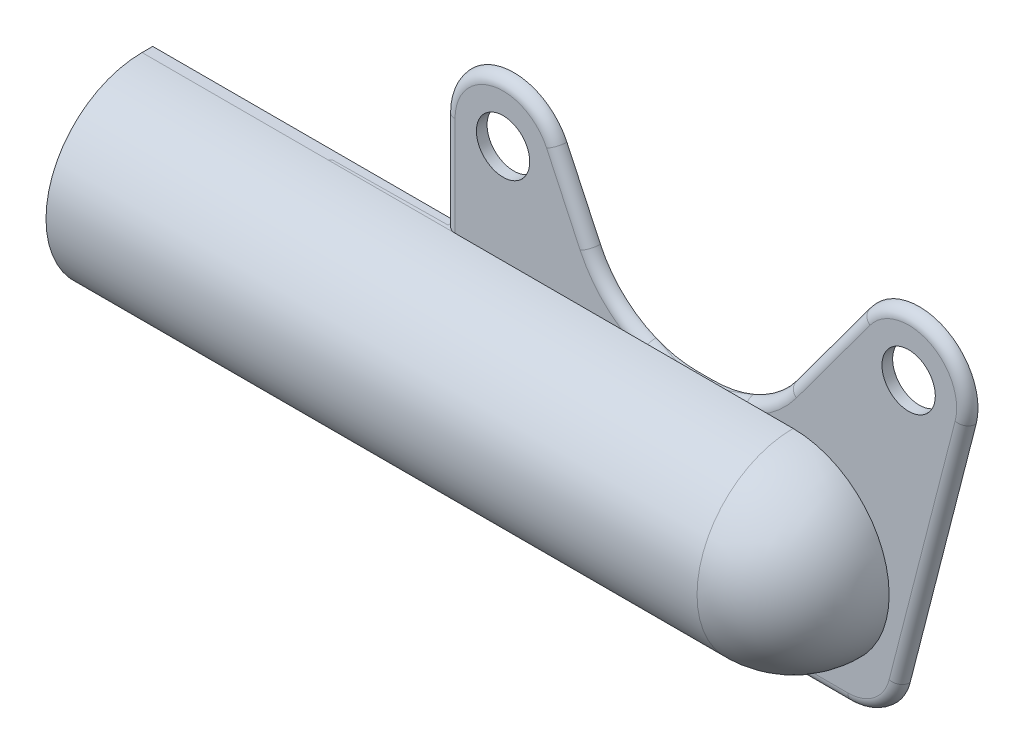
ISO-10303-21;
HEADER;
FILE_DESCRIPTION(('STEP AP214'),'2;1');
FILE_NAME('part.step','',(''),(''),'','','');
FILE_SCHEMA(('AUTOMOTIVE_DESIGN { 1 0 10303 214 1 1 1 1 }'));
ENDSEC;
DATA;
#1=APPLICATION_CONTEXT('core data for automotive mechanical design processes');
#2=APPLICATION_PROTOCOL_DEFINITION('international standard','automotive_design',2000,#1);
#3=PRODUCT_CONTEXT('',#1,'mechanical');
#4=PRODUCT('Part','Part','',(#3));
#5=PRODUCT_RELATED_PRODUCT_CATEGORY('part','',(#4));
#6=PRODUCT_DEFINITION_FORMATION('','',#4);
#7=PRODUCT_DEFINITION_CONTEXT('part definition',#1,'design');
#8=PRODUCT_DEFINITION('design','',#6,#7);
#9=PRODUCT_DEFINITION_SHAPE('','',#8);
#10=(LENGTH_UNIT() NAMED_UNIT(*) SI_UNIT(.MILLI.,.METRE.));
#11=(NAMED_UNIT(*) PLANE_ANGLE_UNIT() SI_UNIT($,.RADIAN.));
#12=(NAMED_UNIT(*) SI_UNIT($,.STERADIAN.) SOLID_ANGLE_UNIT());
#13=UNCERTAINTY_MEASURE_WITH_UNIT(LENGTH_MEASURE(1.E-05),#10,'distance_accuracy_value','');
#14=(GEOMETRIC_REPRESENTATION_CONTEXT(3) GLOBAL_UNCERTAINTY_ASSIGNED_CONTEXT((#13)) GLOBAL_UNIT_ASSIGNED_CONTEXT((#10,
#11,#12)) REPRESENTATION_CONTEXT('',''));
#15=CARTESIAN_POINT('',(0.,0.,0.));
#16=DIRECTION('',(0.,0.,1.));
#17=DIRECTION('',(1.,0.,0.));
#18=AXIS2_PLACEMENT_3D('',#15,#16,#17);
#19=CARTESIAN_POINT('',(-60.7146145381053,-19.4340283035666,145.499975));
#20=DIRECTION('',(-1.,0.,0.));
#21=DIRECTION('',(0.,0.,1.));
#22=AXIS2_PLACEMENT_3D('',#19,#20,#21);
#23=PLANE('',#22);
#24=DIRECTION('',(0.,-1.,0.));
#25=VECTOR('',#24,1.);
#26=CARTESIAN_POINT('',(-60.7146145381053,-19.4340283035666,146.499975));
#27=LINE('',#26,#25);
#28=CARTESIAN_POINT('',(-60.7146145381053,-19.4340283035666,146.499975));
#29=VERTEX_POINT('',#28);
#30=CARTESIAN_POINT('',(-60.7146145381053,-37.4340283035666,146.499975));
#31=VERTEX_POINT('',#30);
#32=EDGE_CURVE('E112',#29,#31,#27,.T.);
#33=ORIENTED_EDGE('',*,*,#32,.F.);
#34=DIRECTION('',(0.,0.,1.));
#35=VECTOR('',#34,1.);
#36=CARTESIAN_POINT('',(-60.7146145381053,-19.4340283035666,145.499975));
#37=LINE('',#36,#35);
#38=CARTESIAN_POINT('',(-60.7146145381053,-19.4340283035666,145.499975));
#39=VERTEX_POINT('',#38);
#40=EDGE_CURVE('E12',#39,#29,#37,.T.);
#41=ORIENTED_EDGE('',*,*,#40,.F.);
#42=DIRECTION('',(0.,-1.,0.));
#43=VECTOR('',#42,1.);
#44=CARTESIAN_POINT('',(-60.7146145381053,-19.4340283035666,145.499975));
#45=LINE('',#44,#43);
#46=CARTESIAN_POINT('',(-60.7146145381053,-37.4340283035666,145.499975));
#47=VERTEX_POINT('',#46);
#48=EDGE_CURVE('E106',#39,#47,#45,.T.);
#49=ORIENTED_EDGE('',*,*,#48,.T.);
#50=DIRECTION('',(0.,0.,1.));
#51=VECTOR('',#50,1.);
#52=CARTESIAN_POINT('',(-60.7146145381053,-37.4340283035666,145.499975));
#53=LINE('',#52,#51);
#54=EDGE_CURVE('E51',#47,#31,#53,.T.);
#55=ORIENTED_EDGE('',*,*,#54,.T.);
#56=EDGE_LOOP('',(#33,#41,#49,#55));
#57=FACE_BOUND('',#56,.T.);
#58=ADVANCED_FACE('F48',(#57),#23,.T.);
#59=CARTESIAN_POINT('',(-60.7146145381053,-19.4340283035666,145.499975));
#60=DIRECTION('',(0.,1.,0.));
#61=DIRECTION('',(-1.,0.,0.));
#62=AXIS2_PLACEMENT_3D('',#59,#60,#61);
#63=PLANE('',#62);
#64=DIRECTION('',(-1.,0.,0.));
#65=VECTOR('',#64,1.);
#66=CARTESIAN_POINT('',(-60.7146145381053,-19.4340283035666,146.499975));
#67=LINE('',#66,#65);
#68=CARTESIAN_POINT('',(-32.3896285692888,-19.4340283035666,146.499975));
#69=VERTEX_POINT('',#68);
#70=EDGE_CURVE('E108',#69,#29,#67,.T.);
#71=ORIENTED_EDGE('',*,*,#70,.F.);
#72=DIRECTION('',(0.,0.,1.));
#73=VECTOR('',#72,1.);
#74=CARTESIAN_POINT('',(-32.3896285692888,-19.4340283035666,145.499975));
#75=LINE('',#74,#73);
#76=CARTESIAN_POINT('',(-32.3896285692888,-19.4340283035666,145.499975));
#77=VERTEX_POINT('',#76);
#78=EDGE_CURVE('E57',#77,#69,#75,.T.);
#79=ORIENTED_EDGE('',*,*,#78,.F.);
#80=DIRECTION('',(-1.,0.,0.));
#81=VECTOR('',#80,1.);
#82=CARTESIAN_POINT('',(-60.7146145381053,-19.4340283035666,145.499975));
#83=LINE('',#82,#81);
#84=EDGE_CURVE('E103',#77,#39,#83,.T.);
#85=ORIENTED_EDGE('',*,*,#84,.T.);
#86=ORIENTED_EDGE('',*,*,#40,.T.);
#87=EDGE_LOOP('',(#71,#79,#85,#86));
#88=FACE_BOUND('',#87,.T.);
#89=ADVANCED_FACE('F122',(#88),#63,.T.);
#90=CARTESIAN_POINT('',(-32.3896285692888,-19.4340283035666,145.499975));
#91=DIRECTION('',(1.,0.,0.));
#92=DIRECTION('',(0.,0.,-1.));
#93=AXIS2_PLACEMENT_3D('',#90,#91,#92);
#94=PLANE('',#93);
#95=DIRECTION('',(0.,1.,0.));
#96=VECTOR('',#95,1.);
#97=CARTESIAN_POINT('',(-32.3896285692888,-19.4340283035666,146.499975));
#98=LINE('',#97,#96);
#99=CARTESIAN_POINT('',(-32.3896285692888,-37.4340283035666,146.499975));
#100=VERTEX_POINT('',#99);
#101=EDGE_CURVE('E98',#100,#69,#98,.T.);
#102=ORIENTED_EDGE('',*,*,#101,.F.);
#103=DIRECTION('',(0.,0.,1.));
#104=VECTOR('',#103,1.);
#105=CARTESIAN_POINT('',(-32.3896285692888,-37.4340283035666,145.499975));
#106=LINE('',#105,#104);
#107=CARTESIAN_POINT('',(-32.3896285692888,-37.4340283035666,145.499975));
#108=VERTEX_POINT('',#107);
#109=EDGE_CURVE('E93',#108,#100,#106,.T.);
#110=ORIENTED_EDGE('',*,*,#109,.F.);
#111=DIRECTION('',(0.,1.,0.));
#112=VECTOR('',#111,1.);
#113=CARTESIAN_POINT('',(-32.3896285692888,-19.4340283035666,145.499975));
#114=LINE('',#113,#112);
#115=EDGE_CURVE('E96',#108,#77,#114,.T.);
#116=ORIENTED_EDGE('',*,*,#115,.T.);
#117=ORIENTED_EDGE('',*,*,#78,.T.);
#118=EDGE_LOOP('',(#102,#110,#116,#117));
#119=FACE_BOUND('',#118,.T.);
#120=ADVANCED_FACE('F95',(#119),#94,.T.);
#121=CARTESIAN_POINT('',(-60.7146145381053,-37.4340283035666,145.499975));
#122=DIRECTION('',(0.,-1.,0.));
#123=DIRECTION('',(1.,0.,0.));
#124=AXIS2_PLACEMENT_3D('',#121,#122,#123);
#125=PLANE('',#124);
#126=DIRECTION('',(1.,0.,0.));
#127=VECTOR('',#126,1.);
#128=CARTESIAN_POINT('',(-60.7146145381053,-37.4340283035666,146.499975));
#129=LINE('',#128,#127);
#130=EDGE_CURVE('E115',#31,#100,#129,.T.);
#131=ORIENTED_EDGE('',*,*,#130,.F.);
#132=ORIENTED_EDGE('',*,*,#54,.F.);
#133=DIRECTION('',(1.,0.,0.));
#134=VECTOR('',#133,1.);
#135=CARTESIAN_POINT('',(-60.7146145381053,-37.4340283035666,145.499975));
#136=LINE('',#135,#134);
#137=EDGE_CURVE('E102',#47,#108,#136,.T.);
#138=ORIENTED_EDGE('',*,*,#137,.T.);
#139=ORIENTED_EDGE('',*,*,#109,.T.);
#140=EDGE_LOOP('',(#131,#132,#138,#139));
#141=FACE_BOUND('',#140,.T.);
#142=ADVANCED_FACE('F105',(#141),#125,.T.);
#143=CARTESIAN_POINT('',(0.,0.,145.499975));
#144=DIRECTION('',(0.,0.,1.));
#145=DIRECTION('',(1.,0.,0.));
#146=AXIS2_PLACEMENT_3D('',#143,#144,#145);
#147=PLANE('',#146);
#148=ORIENTED_EDGE('',*,*,#48,.F.);
#149=ORIENTED_EDGE('',*,*,#84,.F.);
#150=ORIENTED_EDGE('',*,*,#115,.F.);
#151=ORIENTED_EDGE('',*,*,#137,.F.);
#152=EDGE_LOOP('',(#148,#149,#150,#151));
#153=FACE_BOUND('',#152,.T.);
#154=ADVANCED_FACE('F101',(#153),#147,.F.);
#155=CARTESIAN_POINT('',(0.,0.,146.499975));
#156=DIRECTION('',(0.,0.,1.));
#157=DIRECTION('',(1.,0.,0.));
#158=AXIS2_PLACEMENT_3D('',#155,#156,#157);
#159=PLANE('',#158);
#160=ORIENTED_EDGE('',*,*,#32,.T.);
#161=ORIENTED_EDGE('',*,*,#130,.T.);
#162=ORIENTED_EDGE('',*,*,#101,.T.);
#163=ORIENTED_EDGE('',*,*,#70,.T.);
#164=EDGE_LOOP('',(#160,#161,#162,#163));
#165=FACE_BOUND('',#164,.T.);
#166=ADVANCED_FACE('F121',(#165),#159,.T.);
#167=CLOSED_SHELL('',(#58,#89,#120,#142,#154,#166));
#168=MANIFOLD_SOLID_BREP('B2',#167);
#169=CARTESIAN_POINT('',(-16.0694657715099,-20.2830048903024,145.499975));
#170=DIRECTION('',(0.,1.,0.));
#171=DIRECTION('',(-1.,0.,0.));
#172=AXIS2_PLACEMENT_3D('',#169,#170,#171);
#173=PLANE('',#172);
#174=DIRECTION('',(0.,0.,1.));
#175=VECTOR('',#174,1.);
#176=CARTESIAN_POINT('',(-9.70765564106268,-20.2830048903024,146.499975));
#177=LINE('',#176,#175);
#178=CARTESIAN_POINT('',(-9.70765564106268,-20.2830048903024,145.499975));
#179=VERTEX_POINT('',#178);
#180=CARTESIAN_POINT('',(-9.70765564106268,-20.2830048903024,145.971544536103));
#181=VERTEX_POINT('',#180);
#182=EDGE_CURVE('E441',#179,#181,#177,.T.);
#183=ORIENTED_EDGE('',*,*,#182,.T.);
#184=DIRECTION('',(1.,0.,0.));
#185=VECTOR('',#184,1.);
#186=CARTESIAN_POINT('',(-9.70765564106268,-20.2830048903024,145.971544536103));
#187=LINE('',#186,#185);
#188=CARTESIAN_POINT('',(-8.25695071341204,-20.2830048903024,145.971544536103));
#189=VERTEX_POINT('',#188);
#190=EDGE_CURVE('E205',#181,#189,#187,.T.);
#191=ORIENTED_EDGE('',*,*,#190,.T.);
#192=DIRECTION('',(0.,0.,1.));
#193=VECTOR('',#192,1.);
#194=CARTESIAN_POINT('',(-8.25695071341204,-20.2830048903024,145.499975));
#195=LINE('',#194,#193);
#196=CARTESIAN_POINT('',(-8.25695071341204,-20.2830048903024,145.499975));
#197=VERTEX_POINT('',#196);
#198=EDGE_CURVE('E446',#189,#197,#195,.F.);
#199=ORIENTED_EDGE('',*,*,#198,.T.);
#200=DIRECTION('',(-1.,0.,0.));
#201=VECTOR('',#200,1.);
#202=CARTESIAN_POINT('',(-16.0694657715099,-20.2830048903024,145.499975));
#203=LINE('',#202,#201);
#204=EDGE_CURVE('E419',#197,#179,#203,.T.);
#205=ORIENTED_EDGE('',*,*,#204,.T.);
#206=EDGE_LOOP('',(#183,#191,#199,#205));
#207=FACE_BOUND('',#206,.T.);
#208=ADVANCED_FACE('F181',(#207),#173,.T.);
#209=CARTESIAN_POINT('',(-32.3896285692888,-39.3330048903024,145.499975));
#210=DIRECTION('',(-1.,0.,0.));
#211=DIRECTION('',(0.,-1.,0.));
#212=AXIS2_PLACEMENT_3D('',#209,#210,#211);
#213=PLANE('',#212);
#214=DIRECTION('',(0.,-1.,0.));
#215=VECTOR('',#214,1.);
#216=CARTESIAN_POINT('',(-32.3896285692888,-39.3330048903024,145.499975));
#217=LINE('',#216,#215);
#218=CARTESIAN_POINT('',(-32.3896285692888,-37.4340283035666,145.499975));
#219=VERTEX_POINT('',#218);
#220=CARTESIAN_POINT('',(-32.3896285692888,-39.3330048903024,145.499975));
#221=VERTEX_POINT('',#220);
#222=EDGE_CURVE('E404',#219,#221,#217,.T.);
#223=ORIENTED_EDGE('',*,*,#222,.T.);
#224=CARTESIAN_POINT('',(-32.3896285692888,-38.3330048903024,145.499975));
#225=DIRECTION('',(-1.,0.,0.));
#226=DIRECTION('',(0.,-1.,0.));
#227=AXIS2_PLACEMENT_3D('',#224,#225,#226);
#228=CIRCLE('',#227,1.);
#229=CARTESIAN_POINT('',(-32.3896285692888,-38.3330048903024,146.499975));
#230=VERTEX_POINT('',#229);
#231=EDGE_CURVE('E479',#221,#230,#228,.T.);
#232=ORIENTED_EDGE('',*,*,#231,.T.);
#233=DIRECTION('',(0.,-1.,0.));
#234=VECTOR('',#233,1.);
#235=CARTESIAN_POINT('',(-32.3896285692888,-39.3330048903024,146.499975));
#236=LINE('',#235,#234);
#237=CARTESIAN_POINT('',(-32.3896285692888,-37.4340283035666,146.499975));
#238=VERTEX_POINT('',#237);
#239=EDGE_CURVE('E395',#238,#230,#236,.T.);
#240=ORIENTED_EDGE('',*,*,#239,.F.);
#241=DIRECTION('',(0.,0.,1.));
#242=VECTOR('',#241,1.);
#243=CARTESIAN_POINT('',(-32.3896285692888,-37.4340283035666,145.499975));
#244=LINE('',#243,#242);
#245=EDGE_CURVE('E439',#219,#238,#244,.T.);
#246=ORIENTED_EDGE('',*,*,#245,.F.);
#247=EDGE_LOOP('',(#223,#232,#240,#246));
#248=FACE_BOUND('',#247,.T.);
#249=ADVANCED_FACE('F542',(#248),#213,.T.);
#250=CARTESIAN_POINT('',(-32.3896285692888,-37.4340283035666,145.499975));
#251=DIRECTION('',(0.,-1.,0.));
#252=DIRECTION('',(0.,0.,-1.));
#253=AXIS2_PLACEMENT_3D('',#250,#251,#252);
#254=PLANE('',#253);
#255=DIRECTION('',(1.,0.,0.));
#256=VECTOR('',#255,1.);
#257=CARTESIAN_POINT('',(-32.3896285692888,-37.4340283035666,146.499975));
#258=LINE('',#257,#256);
#259=CARTESIAN_POINT('',(-60.7146145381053,-37.4340283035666,146.499975));
#260=VERTEX_POINT('',#259);
#261=EDGE_CURVE('E434',#260,#238,#258,.T.);
#262=ORIENTED_EDGE('',*,*,#261,.F.);
#263=DIRECTION('',(0.,0.,1.));
#264=VECTOR('',#263,1.);
#265=CARTESIAN_POINT('',(-60.7146145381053,-37.4340283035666,145.499975));
#266=LINE('',#265,#264);
#267=CARTESIAN_POINT('',(-60.7146145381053,-37.4340283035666,145.499975));
#268=VERTEX_POINT('',#267);
#269=EDGE_CURVE('E442',#268,#260,#266,.T.);
#270=ORIENTED_EDGE('',*,*,#269,.F.);
#271=DIRECTION('',(1.,0.,0.));
#272=VECTOR('',#271,1.);
#273=CARTESIAN_POINT('',(-32.3896285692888,-37.4340283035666,145.499975));
#274=LINE('',#273,#272);
#275=EDGE_CURVE('E401',#268,#219,#274,.T.);
#276=ORIENTED_EDGE('',*,*,#275,.T.);
#277=ORIENTED_EDGE('',*,*,#245,.T.);
#278=EDGE_LOOP('',(#262,#270,#276,#277));
#279=FACE_BOUND('',#278,.T.);
#280=ADVANCED_FACE('F547',(#279),#254,.T.);
#281=CARTESIAN_POINT('',(-60.7146145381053,-19.4340283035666,145.499975));
#282=DIRECTION('',(-1.,0.,0.));
#283=DIRECTION('',(0.,0.,1.));
#284=AXIS2_PLACEMENT_3D('',#281,#282,#283);
#285=PLANE('',#284);
#286=DIRECTION('',(0.,-1.,0.));
#287=VECTOR('',#286,1.);
#288=CARTESIAN_POINT('',(-60.7146145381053,-19.4340283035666,146.499975));
#289=LINE('',#288,#287);
#290=CARTESIAN_POINT('',(-60.7146145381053,-19.4340283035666,146.499975));
#291=VERTEX_POINT('',#290);
#292=EDGE_CURVE('E431',#291,#260,#289,.T.);
#293=ORIENTED_EDGE('',*,*,#292,.F.);
#294=DIRECTION('',(0.,0.,1.));
#295=VECTOR('',#294,1.);
#296=CARTESIAN_POINT('',(-60.7146145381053,-19.4340283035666,145.499975));
#297=LINE('',#296,#295);
#298=CARTESIAN_POINT('',(-60.7146145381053,-19.4340283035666,145.499975));
#299=VERTEX_POINT('',#298);
#300=EDGE_CURVE('E428',#299,#291,#297,.T.);
#301=ORIENTED_EDGE('',*,*,#300,.F.);
#302=DIRECTION('',(0.,-1.,0.));
#303=VECTOR('',#302,1.);
#304=CARTESIAN_POINT('',(-60.7146145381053,-19.4340283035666,145.499975));
#305=LINE('',#304,#303);
#306=EDGE_CURVE('E398',#299,#268,#305,.T.);
#307=ORIENTED_EDGE('',*,*,#306,.T.);
#308=ORIENTED_EDGE('',*,*,#269,.T.);
#309=EDGE_LOOP('',(#293,#301,#307,#308));
#310=FACE_BOUND('',#309,.T.);
#311=ADVANCED_FACE('F556',(#310),#285,.T.);
#312=CARTESIAN_POINT('',(-32.3896285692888,-19.4340283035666,145.499975));
#313=DIRECTION('',(0.,1.,0.));
#314=DIRECTION('',(0.,0.,1.));
#315=AXIS2_PLACEMENT_3D('',#312,#313,#314);
#316=PLANE('',#315);
#317=DIRECTION('',(-1.,0.,0.));
#318=VECTOR('',#317,1.);
#319=CARTESIAN_POINT('',(-32.3896285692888,-19.4340283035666,146.499975));
#320=LINE('',#319,#318);
#321=CARTESIAN_POINT('',(-31.3896285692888,-19.4340283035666,146.499975));
#322=VERTEX_POINT('',#321);
#323=EDGE_CURVE('E388',#322,#291,#320,.T.);
#324=ORIENTED_EDGE('',*,*,#323,.F.);
#325=CARTESIAN_POINT('',(-31.3896285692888,-19.4340283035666,145.499975));
#326=DIRECTION('',(0.,1.,0.));
#327=DIRECTION('',(0.,0.,1.));
#328=AXIS2_PLACEMENT_3D('',#325,#326,#327);
#329=CIRCLE('',#328,1.);
#330=CARTESIAN_POINT('',(-32.3896285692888,-19.4340283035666,145.499975));
#331=VERTEX_POINT('',#330);
#332=EDGE_CURVE('E46',#322,#331,#329,.F.);
#333=ORIENTED_EDGE('',*,*,#332,.T.);
#334=DIRECTION('',(-1.,0.,0.));
#335=VECTOR('',#334,1.);
#336=CARTESIAN_POINT('',(-32.3896285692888,-19.4340283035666,145.499975));
#337=LINE('',#336,#335);
#338=EDGE_CURVE('E394',#331,#299,#337,.T.);
#339=ORIENTED_EDGE('',*,*,#338,.T.);
#340=ORIENTED_EDGE('',*,*,#300,.T.);
#341=EDGE_LOOP('',(#324,#333,#339,#340));
#342=FACE_BOUND('',#341,.T.);
#343=ADVANCED_FACE('F560',(#342),#316,.T.);
#344=CARTESIAN_POINT('',(11.1103714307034,-10.1344471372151,145.499975));
#345=DIRECTION('',(0.,0.,1.));
#346=DIRECTION('',(1.,0.,0.));
#347=AXIS2_PLACEMENT_3D('',#344,#345,#346);
#348=PLANE('',#347);
#349=DIRECTION('',(1.,0.,0.));
#350=VECTOR('',#349,1.);
#351=CARTESIAN_POINT('',(0.285385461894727,-36.4340283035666,145.499975));
#352=LINE('',#351,#350);
#353=CARTESIAN_POINT('',(-32.3896285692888,-36.4340283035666,145.499975));
#354=VERTEX_POINT('',#353);
#355=CARTESIAN_POINT('',(0.285385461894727,-36.4340283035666,145.499975));
#356=VERTEX_POINT('',#355);
#357=EDGE_CURVE('E344',#354,#356,#352,.T.);
#358=ORIENTED_EDGE('',*,*,#357,.T.);
#359=CARTESIAN_POINT('',(0.285385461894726,-28.4340283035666,145.499975));
#360=DIRECTION('',(0.,0.,1.));
#361=DIRECTION('',(1.,0.,0.));
#362=AXIS2_PLACEMENT_3D('',#359,#360,#361);
#363=CIRCLE('',#362,8.);
#364=CARTESIAN_POINT('',(0.285385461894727,-20.4340283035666,145.499975));
#365=VERTEX_POINT('',#364);
#366=EDGE_CURVE('E336',#356,#365,#363,.T.);
#367=ORIENTED_EDGE('',*,*,#366,.T.);
#368=DIRECTION('',(-1.,0.,0.));
#369=VECTOR('',#368,1.);
#370=CARTESIAN_POINT('',(0.285385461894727,-20.4340283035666,145.499975));
#371=LINE('',#370,#369);
#372=CARTESIAN_POINT('',(-32.3896285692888,-20.4340283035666,145.499975));
#373=VERTEX_POINT('',#372);
#374=EDGE_CURVE('E348',#365,#373,#371,.T.);
#375=ORIENTED_EDGE('',*,*,#374,.T.);
#376=DIRECTION('',(0.,-1.,0.));
#377=VECTOR('',#376,1.);
#378=CARTESIAN_POINT('',(-32.3896285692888,-20.4340283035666,145.499975));
#379=LINE('',#378,#377);
#380=EDGE_CURVE('E353',#373,#354,#379,.T.);
#381=ORIENTED_EDGE('',*,*,#380,.T.);
#382=EDGE_LOOP('',(#358,#367,#375,#381));
#383=FACE_BOUND('',#382,.T.);
#384=CARTESIAN_POINT('',(-26.8896285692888,-10.1344471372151,145.499975));
#385=DIRECTION('',(0.,0.,1.));
#386=DIRECTION('',(1.,0.,0.));
#387=AXIS2_PLACEMENT_3D('',#384,#385,#386);
#388=CIRCLE('',#387,2.49999999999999);
#389=CARTESIAN_POINT('',(-24.3896285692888,-10.1344471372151,145.499975));
#390=VERTEX_POINT('',#389);
#391=EDGE_CURVE('E379',#390,#390,#388,.T.);
#392=ORIENTED_EDGE('',*,*,#391,.T.);
#393=EDGE_LOOP('',(#392));
#394=FACE_BOUND('',#393,.T.);
#395=CARTESIAN_POINT('',(11.1103714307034,-10.1344471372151,145.499975));
#396=DIRECTION('',(0.,0.,1.));
#397=DIRECTION('',(1.,0.,0.));
#398=AXIS2_PLACEMENT_3D('',#395,#396,#397);
#399=CIRCLE('',#398,2.5);
#400=CARTESIAN_POINT('',(13.6103714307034,-10.1344471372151,145.499975));
#401=VERTEX_POINT('',#400);
#402=EDGE_CURVE('E385',#401,#401,#399,.T.);
#403=ORIENTED_EDGE('',*,*,#402,.T.);
#404=EDGE_LOOP('',(#403));
#405=FACE_BOUND('',#404,.T.);
#406=DIRECTION('',(0.24890105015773,0.968528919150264,0.));
#407=VECTOR('',#406,1.);
#408=CARTESIAN_POINT('',(9.28538546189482,-39.3330048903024,145.499975));
#409=LINE('',#408,#407);
#410=CARTESIAN_POINT('',(10.2505054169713,-35.5775101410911,145.499975));
#411=VERTEX_POINT('',#410);
#412=CARTESIAN_POINT('',(16.4372804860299,-11.5034029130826,145.499975));
#413=VERTEX_POINT('',#412);
#414=EDGE_CURVE('E410',#411,#413,#409,.T.);
#415=ORIENTED_EDGE('',*,*,#414,.F.);
#416=CARTESIAN_POINT('',(5.40786082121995,-34.3330048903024,145.499975));
#417=DIRECTION('',(0.,0.,1.));
#418=DIRECTION('',(1.,0.,0.));
#419=AXIS2_PLACEMENT_3D('',#416,#417,#418);
#420=CIRCLE('',#419,5.);
#421=CARTESIAN_POINT('',(5.40786082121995,-39.3330048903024,145.499975));
#422=VERTEX_POINT('',#421);
#423=EDGE_CURVE('E455',#411,#422,#420,.F.);
#424=ORIENTED_EDGE('',*,*,#423,.T.);
#425=DIRECTION('',(1.,0.,0.));
#426=VECTOR('',#425,1.);
#427=CARTESIAN_POINT('',(-32.3896285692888,-39.3330048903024,145.499975));
#428=LINE('',#427,#426);
#429=EDGE_CURVE('E407',#221,#422,#428,.T.);
#430=ORIENTED_EDGE('',*,*,#429,.F.);
#431=ORIENTED_EDGE('',*,*,#222,.F.);
#432=ORIENTED_EDGE('',*,*,#275,.F.);
#433=ORIENTED_EDGE('',*,*,#306,.F.);
#434=ORIENTED_EDGE('',*,*,#338,.F.);
#435=DIRECTION('',(0.,-1.,0.));
#436=VECTOR('',#435,1.);
#437=CARTESIAN_POINT('',(-32.3896285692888,-10.1344471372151,145.499975));
#438=LINE('',#437,#436);
#439=CARTESIAN_POINT('',(-32.3896285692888,-10.1344471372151,145.499975));
#440=VERTEX_POINT('',#439);
#441=EDGE_CURVE('E391',#440,#331,#438,.T.);
#442=ORIENTED_EDGE('',*,*,#441,.F.);
#443=CARTESIAN_POINT('',(-26.8896285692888,-10.1344471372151,145.499975));
#444=DIRECTION('',(0.,0.,1.));
#445=DIRECTION('',(1.,0.,0.));
#446=AXIS2_PLACEMENT_3D('',#443,#444,#445);
#447=CIRCLE('',#446,5.5);
#448=CARTESIAN_POINT('',(-21.907881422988,-7.80374008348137,145.499975));
#449=VERTEX_POINT('',#448);
#450=EDGE_CURVE('E425',#449,#440,#447,.T.);
#451=ORIENTED_EDGE('',*,*,#450,.F.);
#452=DIRECTION('',(-0.42376491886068,0.90577220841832,0.));
#453=VECTOR('',#452,1.);
#454=CARTESIAN_POINT('',(-16.0694657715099,-20.2830048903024,145.499975));
#455=LINE('',#454,#453);
#456=CARTESIAN_POINT('',(-18.7653777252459,-14.5206540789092,145.499975));
#457=VERTEX_POINT('',#456);
#458=EDGE_CURVE('E422',#457,#449,#455,.T.);
#459=ORIENTED_EDGE('',*,*,#458,.F.);
#460=CARTESIAN_POINT('',(-9.70765564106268,-10.2830048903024,145.499975));
#461=DIRECTION('',(0.,0.,1.));
#462=DIRECTION('',(1.,0.,0.));
#463=AXIS2_PLACEMENT_3D('',#460,#461,#462);
#464=CIRCLE('',#463,10.);
#465=CARTESIAN_POINT('',(-13.5599624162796,-19.5112079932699,145.499975));
#466=VERTEX_POINT('',#465);
#467=EDGE_CURVE('E452',#457,#466,#464,.T.);
#468=ORIENTED_EDGE('',*,*,#467,.T.);
#469=EDGE_CURVE('E451',#466,#179,#464,.T.);
#470=ORIENTED_EDGE('',*,*,#469,.T.);
#471=ORIENTED_EDGE('',*,*,#204,.F.);
#472=CARTESIAN_POINT('',(-8.25695071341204,-10.2830048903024,145.499975));
#473=DIRECTION('',(0.,0.,1.));
#474=DIRECTION('',(1.,0.,0.));
#475=AXIS2_PLACEMENT_3D('',#472,#473,#474);
#476=CIRCLE('',#475,10.);
#477=CARTESIAN_POINT('',(-4.40464393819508,-19.5112079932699,145.499975));
#478=VERTEX_POINT('',#477);
#479=EDGE_CURVE('E449',#197,#478,#476,.T.);
#480=ORIENTED_EDGE('',*,*,#479,.T.);
#481=CARTESIAN_POINT('',(-0.20825827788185,-16.2175267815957,145.499975));
#482=VERTEX_POINT('',#481);
#483=EDGE_CURVE('E448',#478,#482,#476,.T.);
#484=ORIENTED_EDGE('',*,*,#483,.T.);
#485=DIRECTION('',(-0.593452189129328,-0.804869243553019,0.));
#486=VECTOR('',#485,1.);
#487=CARTESIAN_POINT('',(-3.20584689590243,-20.2830048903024,145.499975));
#488=LINE('',#487,#486);
#489=CARTESIAN_POINT('',(6.6835905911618,-6.87046009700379,145.499975));
#490=VERTEX_POINT('',#489);
#491=EDGE_CURVE('E416',#490,#482,#488,.T.);
#492=ORIENTED_EDGE('',*,*,#491,.F.);
#493=CARTESIAN_POINT('',(11.1103714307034,-10.1344471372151,145.499975));
#494=DIRECTION('',(0.,0.,1.));
#495=DIRECTION('',(1.,0.,0.));
#496=AXIS2_PLACEMENT_3D('',#493,#494,#495);
#497=CIRCLE('',#496,5.5);
#498=EDGE_CURVE('E413',#413,#490,#497,.T.);
#499=ORIENTED_EDGE('',*,*,#498,.F.);
#500=EDGE_LOOP('',(#415,#424,#430,#431,#432,#433,#434,#442,#451,#459,#468,#470,#471,#480,#484,
#492,#499));
#501=FACE_BOUND('',#500,.T.);
#502=ADVANCED_FACE('F355',(#383,#394,#405,#501),#348,.F.);
#503=CARTESIAN_POINT('',(11.1103714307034,-10.1344471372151,146.499975));
#504=DIRECTION('',(0.,0.,1.));
#505=DIRECTION('',(1.,0.,0.));
#506=AXIS2_PLACEMENT_3D('',#503,#504,#505);
#507=PLANE('',#506);
#508=CARTESIAN_POINT('',(-26.8896285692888,-10.1344471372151,146.499975));
#509=DIRECTION('',(0.,0.,1.));
#510=DIRECTION('',(1.,0.,0.));
#511=AXIS2_PLACEMENT_3D('',#508,#509,#510);
#512=CIRCLE('',#511,2.49999999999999);
#513=CARTESIAN_POINT('',(-24.3896285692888,-10.1344471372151,146.499975));
#514=VERTEX_POINT('',#513);
#515=EDGE_CURVE('E375',#514,#514,#512,.T.);
#516=ORIENTED_EDGE('',*,*,#515,.F.);
#517=EDGE_LOOP('',(#516));
#518=FACE_BOUND('',#517,.T.);
#519=CARTESIAN_POINT('',(11.1103714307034,-10.1344471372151,146.499975));
#520=DIRECTION('',(0.,0.,1.));
#521=DIRECTION('',(1.,0.,0.));
#522=AXIS2_PLACEMENT_3D('',#519,#520,#521);
#523=CIRCLE('',#522,2.5);
#524=CARTESIAN_POINT('',(13.6103714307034,-10.1344471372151,146.499975));
#525=VERTEX_POINT('',#524);
#526=EDGE_CURVE('E382',#525,#525,#523,.T.);
#527=ORIENTED_EDGE('',*,*,#526,.F.);
#528=EDGE_LOOP('',(#527));
#529=FACE_BOUND('',#528,.T.);
#530=DIRECTION('',(0.,-1.,0.));
#531=VECTOR('',#530,1.);
#532=CARTESIAN_POINT('',(-31.3896285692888,-10.1344471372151,146.499975));
#533=LINE('',#532,#531);
#534=CARTESIAN_POINT('',(-31.3896285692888,-10.1344471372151,146.499975));
#535=VERTEX_POINT('',#534);
#536=EDGE_CURVE('E476',#535,#322,#533,.T.);
#537=ORIENTED_EDGE('',*,*,#536,.T.);
#538=ORIENTED_EDGE('',*,*,#323,.T.);
#539=ORIENTED_EDGE('',*,*,#292,.T.);
#540=ORIENTED_EDGE('',*,*,#261,.T.);
#541=ORIENTED_EDGE('',*,*,#239,.T.);
#542=DIRECTION('',(1.,0.,0.));
#543=VECTOR('',#542,1.);
#544=CARTESIAN_POINT('',(11.1103714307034,-38.3330048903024,146.499975));
#545=LINE('',#544,#543);
#546=CARTESIAN_POINT('',(5.40786082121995,-38.3330048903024,146.499975));
#547=VERTEX_POINT('',#546);
#548=EDGE_CURVE('E467',#230,#547,#545,.T.);
#549=ORIENTED_EDGE('',*,*,#548,.T.);
#550=CARTESIAN_POINT('',(5.40786082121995,-34.3330048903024,146.499975));
#551=DIRECTION('',(0.,0.,1.));
#552=DIRECTION('',(1.,0.,0.));
#553=AXIS2_PLACEMENT_3D('',#550,#551,#552);
#554=CIRCLE('',#553,4.);
#555=CARTESIAN_POINT('',(9.28197649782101,-35.3286090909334,146.499975));
#556=VERTEX_POINT('',#555);
#557=EDGE_CURVE('E465',#547,#556,#554,.T.);
#558=ORIENTED_EDGE('',*,*,#557,.T.);
#559=DIRECTION('',(0.24890105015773,0.968528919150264,0.));
#560=VECTOR('',#559,1.);
#561=CARTESIAN_POINT('',(15.4687515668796,-11.2545018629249,146.499975));
#562=LINE('',#561,#560);
#563=CARTESIAN_POINT('',(15.4687515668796,-11.2545018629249,146.499975));
#564=VERTEX_POINT('',#563);
#565=EDGE_CURVE('E463',#556,#564,#562,.T.);
#566=ORIENTED_EDGE('',*,*,#565,.T.);
#567=CARTESIAN_POINT('',(11.1103714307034,-10.1344471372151,146.499975));
#568=DIRECTION('',(0.,0.,1.));
#569=DIRECTION('',(1.,0.,0.));
#570=AXIS2_PLACEMENT_3D('',#567,#568,#569);
#571=CIRCLE('',#570,4.5);
#572=CARTESIAN_POINT('',(7.48845983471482,-7.46391228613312,146.499975));
#573=VERTEX_POINT('',#572);
#574=EDGE_CURVE('E461',#564,#573,#571,.T.);
#575=ORIENTED_EDGE('',*,*,#574,.T.);
#576=DIRECTION('',(-0.593452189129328,-0.804869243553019,0.));
#577=VECTOR('',#576,1.);
#578=CARTESIAN_POINT('',(7.48845983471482,-7.46391228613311,146.499975));
#579=LINE('',#578,#577);
#580=CARTESIAN_POINT('',(0.596610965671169,-16.810978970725,146.499975));
#581=VERTEX_POINT('',#580);
#582=EDGE_CURVE('E457',#573,#581,#579,.T.);
#583=ORIENTED_EDGE('',*,*,#582,.T.);
#584=CARTESIAN_POINT('',(-8.25695071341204,-10.2830048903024,146.499975));
#585=DIRECTION('',(0.,0.,1.));
#586=DIRECTION('',(1.,0.,0.));
#587=AXIS2_PLACEMENT_3D('',#584,#585,#586);
#588=CIRCLE('',#587,11.);
#589=CARTESIAN_POINT('',(-4.01941326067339,-20.4340283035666,146.499975));
#590=VERTEX_POINT('',#589);
#591=EDGE_CURVE('E459',#581,#590,#588,.F.);
#592=ORIENTED_EDGE('',*,*,#591,.T.);
#593=DIRECTION('',(-1.,0.,0.));
#594=VECTOR('',#593,1.);
#595=CARTESIAN_POINT('',(0.285385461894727,-20.4340283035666,146.499975));
#596=LINE('',#595,#594);
#597=CARTESIAN_POINT('',(0.285385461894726,-20.4340283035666,146.499975));
#598=VERTEX_POINT('',#597);
#599=EDGE_CURVE('E368',#598,#590,#596,.T.);
#600=ORIENTED_EDGE('',*,*,#599,.F.);
#601=CARTESIAN_POINT('',(0.285385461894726,-28.4340283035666,146.499975));
#602=DIRECTION('',(0.,0.,1.));
#603=DIRECTION('',(1.,0.,0.));
#604=AXIS2_PLACEMENT_3D('',#601,#602,#603);
#605=CIRCLE('',#604,8.);
#606=CARTESIAN_POINT('',(0.285385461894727,-36.4340283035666,146.499975));
#607=VERTEX_POINT('',#606);
#608=EDGE_CURVE('E339',#607,#598,#605,.T.);
#609=ORIENTED_EDGE('',*,*,#608,.F.);
#610=DIRECTION('',(1.,0.,0.));
#611=VECTOR('',#610,1.);
#612=CARTESIAN_POINT('',(0.285385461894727,-36.4340283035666,146.499975));
#613=LINE('',#612,#611);
#614=CARTESIAN_POINT('',(-32.3896285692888,-36.4340283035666,146.499975));
#615=VERTEX_POINT('',#614);
#616=EDGE_CURVE('E358',#615,#607,#613,.T.);
#617=ORIENTED_EDGE('',*,*,#616,.F.);
#618=DIRECTION('',(0.,-1.,0.));
#619=VECTOR('',#618,1.);
#620=CARTESIAN_POINT('',(-32.3896285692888,-20.4340283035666,146.499975));
#621=LINE('',#620,#619);
#622=CARTESIAN_POINT('',(-32.3896285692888,-20.4340283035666,146.499975));
#623=VERTEX_POINT('',#622);
#624=EDGE_CURVE('E361',#623,#615,#621,.T.);
#625=ORIENTED_EDGE('',*,*,#624,.F.);
#626=CARTESIAN_POINT('',(-13.9451930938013,-20.4340283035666,146.499975));
#627=VERTEX_POINT('',#626);
#628=EDGE_CURVE('E367',#627,#623,#596,.T.);
#629=ORIENTED_EDGE('',*,*,#628,.F.);
#630=CARTESIAN_POINT('',(-9.70765564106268,-10.2830048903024,146.499975));
#631=DIRECTION('',(0.,0.,1.));
#632=DIRECTION('',(1.,0.,0.));
#633=AXIS2_PLACEMENT_3D('',#630,#631,#632);
#634=CIRCLE('',#633,11.);
#635=CARTESIAN_POINT('',(-19.6711499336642,-14.9444189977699,146.499975));
#636=VERTEX_POINT('',#635);
#637=EDGE_CURVE('E470',#627,#636,#634,.F.);
#638=ORIENTED_EDGE('',*,*,#637,.T.);
#639=DIRECTION('',(-0.42376491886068,0.905772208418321,0.));
#640=VECTOR('',#639,1.);
#641=CARTESIAN_POINT('',(-15.9897387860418,-22.8132154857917,146.499975));
#642=LINE('',#641,#640);
#643=CARTESIAN_POINT('',(-22.8136536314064,-8.22750500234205,146.499975));
#644=VERTEX_POINT('',#643);
#645=EDGE_CURVE('E472',#636,#644,#642,.T.);
#646=ORIENTED_EDGE('',*,*,#645,.T.);
#647=CARTESIAN_POINT('',(-26.8896285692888,-10.1344471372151,146.499975));
#648=DIRECTION('',(0.,0.,1.));
#649=DIRECTION('',(1.,0.,0.));
#650=AXIS2_PLACEMENT_3D('',#647,#648,#649);
#651=CIRCLE('',#650,4.5);
#652=EDGE_CURVE('E474',#644,#535,#651,.T.);
#653=ORIENTED_EDGE('',*,*,#652,.T.);
#654=EDGE_LOOP('',(#537,#538,#539,#540,#541,#549,#558,#566,#575,#583,#592,#600,#609,#617,#625,
#629,#638,#646,#653));
#655=FACE_BOUND('',#654,.T.);
#656=ADVANCED_FACE('F550',(#518,#529,#655),#507,.T.);
#657=CARTESIAN_POINT('',(11.1103714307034,-10.1344471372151,145.499975));
#658=DIRECTION('',(0.,0.,1.));
#659=DIRECTION('',(1.,0.,0.));
#660=AXIS2_PLACEMENT_3D('',#657,#658,#659);
#661=CYLINDRICAL_SURFACE('',#660,2.5);
#662=ORIENTED_EDGE('',*,*,#402,.F.);
#663=EDGE_LOOP('',(#662));
#664=FACE_BOUND('',#663,.T.);
#665=ORIENTED_EDGE('',*,*,#526,.T.);
#666=EDGE_LOOP('',(#665));
#667=FACE_BOUND('',#666,.T.);
#668=ADVANCED_FACE('F622',(#664,#667),#661,.F.);
#669=CARTESIAN_POINT('',(-26.8896285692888,-10.1344471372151,145.499975));
#670=DIRECTION('',(0.,0.,1.));
#671=DIRECTION('',(1.,0.,0.));
#672=AXIS2_PLACEMENT_3D('',#669,#670,#671);
#673=CYLINDRICAL_SURFACE('',#672,2.49999999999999);
#674=ORIENTED_EDGE('',*,*,#391,.F.);
#675=EDGE_LOOP('',(#674));
#676=FACE_BOUND('',#675,.T.);
#677=ORIENTED_EDGE('',*,*,#515,.T.);
#678=EDGE_LOOP('',(#677));
#679=FACE_BOUND('',#678,.T.);
#680=ADVANCED_FACE('F619',(#676,#679),#673,.F.);
#681=CARTESIAN_POINT('',(0.285385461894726,-28.4340283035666,145.499975));
#682=DIRECTION('',(0.,0.,1.));
#683=DIRECTION('',(1.,0.,0.));
#684=AXIS2_PLACEMENT_3D('',#681,#682,#683);
#685=CYLINDRICAL_SURFACE('',#684,8.);
#686=ORIENTED_EDGE('',*,*,#608,.T.);
#687=DIRECTION('',(0.,0.,1.));
#688=VECTOR('',#687,1.);
#689=CARTESIAN_POINT('',(0.285385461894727,-20.4340283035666,145.499975));
#690=LINE('',#689,#688);
#691=EDGE_CURVE('E332',#365,#598,#690,.T.);
#692=ORIENTED_EDGE('',*,*,#691,.F.);
#693=ORIENTED_EDGE('',*,*,#366,.F.);
#694=DIRECTION('',(0.,0.,1.));
#695=VECTOR('',#694,1.);
#696=CARTESIAN_POINT('',(0.285385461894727,-36.4340283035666,145.499975));
#697=LINE('',#696,#695);
#698=EDGE_CURVE('E373',#356,#607,#697,.T.);
#699=ORIENTED_EDGE('',*,*,#698,.T.);
#700=EDGE_LOOP('',(#686,#692,#693,#699));
#701=FACE_BOUND('',#700,.T.);
#702=ADVANCED_FACE('F334',(#701),#685,.F.);
#703=CARTESIAN_POINT('',(0.285385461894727,-36.4340283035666,145.499975));
#704=DIRECTION('',(0.,-1.,0.));
#705=DIRECTION('',(1.,0.,0.));
#706=AXIS2_PLACEMENT_3D('',#703,#704,#705);
#707=PLANE('',#706);
#708=ORIENTED_EDGE('',*,*,#616,.T.);
#709=ORIENTED_EDGE('',*,*,#698,.F.);
#710=ORIENTED_EDGE('',*,*,#357,.F.);
#711=DIRECTION('',(0.,0.,1.));
#712=VECTOR('',#711,1.);
#713=CARTESIAN_POINT('',(-32.3896285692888,-36.4340283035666,145.499975));
#714=LINE('',#713,#712);
#715=EDGE_CURVE('E376',#354,#615,#714,.T.);
#716=ORIENTED_EDGE('',*,*,#715,.T.);
#717=EDGE_LOOP('',(#708,#709,#710,#716));
#718=FACE_BOUND('',#717,.T.);
#719=ADVANCED_FACE('F618',(#718),#707,.F.);
#720=CARTESIAN_POINT('',(-32.3896285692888,-20.4340283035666,145.499975));
#721=DIRECTION('',(-1.,0.,0.));
#722=DIRECTION('',(0.,-1.,0.));
#723=AXIS2_PLACEMENT_3D('',#720,#721,#722);
#724=PLANE('',#723);
#725=ORIENTED_EDGE('',*,*,#624,.T.);
#726=ORIENTED_EDGE('',*,*,#715,.F.);
#727=ORIENTED_EDGE('',*,*,#380,.F.);
#728=DIRECTION('',(0.,0.,1.));
#729=VECTOR('',#728,1.);
#730=CARTESIAN_POINT('',(-32.3896285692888,-20.4340283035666,145.499975));
#731=LINE('',#730,#729);
#732=EDGE_CURVE('E343',#373,#623,#731,.T.);
#733=ORIENTED_EDGE('',*,*,#732,.T.);
#734=EDGE_LOOP('',(#725,#726,#727,#733));
#735=FACE_BOUND('',#734,.T.);
#736=ADVANCED_FACE('F613',(#735),#724,.F.);
#737=CARTESIAN_POINT('',(0.285385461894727,-20.4340283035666,145.499975));
#738=DIRECTION('',(0.,1.,0.));
#739=DIRECTION('',(-1.,0.,0.));
#740=AXIS2_PLACEMENT_3D('',#737,#738,#739);
#741=PLANE('',#740);
#742=ORIENTED_EDGE('',*,*,#599,.T.);
#743=CARTESIAN_POINT('',(-8.25695071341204,-20.4340283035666,146.499975));
#744=VERTEX_POINT('',#743);
#745=EDGE_CURVE('E370',#590,#744,#596,.T.);
#746=ORIENTED_EDGE('',*,*,#745,.T.);
#747=CARTESIAN_POINT('',(-9.70765564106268,-20.4340283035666,146.499975));
#748=VERTEX_POINT('',#747);
#749=EDGE_CURVE('E680',#744,#748,#596,.T.);
#750=ORIENTED_EDGE('',*,*,#749,.T.);
#751=EDGE_CURVE('E681',#748,#627,#596,.T.);
#752=ORIENTED_EDGE('',*,*,#751,.T.);
#753=ORIENTED_EDGE('',*,*,#628,.T.);
#754=ORIENTED_EDGE('',*,*,#732,.F.);
#755=ORIENTED_EDGE('',*,*,#374,.F.);
#756=ORIENTED_EDGE('',*,*,#691,.T.);
#757=EDGE_LOOP('',(#742,#746,#750,#752,#753,#754,#755,#756));
#758=FACE_BOUND('',#757,.T.);
#759=ADVANCED_FACE('F349',(#758),#741,.F.);
#760=CARTESIAN_POINT('',(-8.25695071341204,-10.2830048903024,145.499975));
#761=DIRECTION('',(0.,0.,-1.));
#762=DIRECTION('',(-1.,0.,0.));
#763=AXIS2_PLACEMENT_3D('',#760,#761,#762);
#764=CYLINDRICAL_SURFACE('',#763,10.);
#765=ORIENTED_EDGE('',*,*,#198,.F.);
#766=CARTESIAN_POINT('',(-10.1083964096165,-20.4340283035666,146.499975));
#767=CARTESIAN_POINT('',(-10.0083393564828,-20.1286857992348,146.207241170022));
#768=CARTESIAN_POINT('',(-9.94008316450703,-20.1403404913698,145.778121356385));
#769=CARTESIAN_POINT('',(-10.0244809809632,-20.4340283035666,146.499975));
#770=CARTESIAN_POINT('',(-9.93019973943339,-20.1425719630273,146.20896693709));
#771=CARTESIAN_POINT('',(-9.86379641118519,-20.1533655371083,145.791851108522));
#772=CARTESIAN_POINT('',(-9.94038732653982,-20.4340283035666,146.499975));
#773=CARTESIAN_POINT('',(-9.85129617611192,-20.1556277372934,146.211227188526));
#774=CARTESIAN_POINT('',(-9.78734763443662,-20.1655085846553,145.805482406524));
#775=CARTESIAN_POINT('',(-9.77179562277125,-20.4340283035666,146.499975));
#776=CARTESIAN_POINT('',(-9.69287066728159,-20.1798720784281,146.216420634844));
#777=CARTESIAN_POINT('',(-9.63408244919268,-20.1880295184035,145.832110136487));
#778=CARTESIAN_POINT('',(-9.68729748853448,-20.4340283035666,146.499975));
#779=CARTESIAN_POINT('',(-9.61325631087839,-20.1910891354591,146.219352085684));
#780=CARTESIAN_POINT('',(-9.55726596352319,-20.1984070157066,145.845106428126));
#781=CARTESIAN_POINT('',(-9.43262862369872,-20.4340283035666,146.499975));
#782=CARTESIAN_POINT('',(-9.3738065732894,-20.2218479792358,146.228591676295));
#783=CARTESIAN_POINT('',(-9.32574881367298,-20.2269431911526,145.882557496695));
#784=CARTESIAN_POINT('',(-9.26182931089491,-20.4340283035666,146.499975));
#785=CARTESIAN_POINT('',(-9.21180615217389,-20.2387428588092,146.235398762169));
#786=CARTESIAN_POINT('',(-9.17047671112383,-20.242420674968,145.905379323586));
#787=CARTESIAN_POINT('',(-8.9220009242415,-20.4340283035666,146.499975));
#788=CARTESIAN_POINT('',(-8.88960361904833,-20.26428067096,146.246993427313));
#789=CARTESIAN_POINT('',(-8.86154181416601,-20.2658891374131,145.941980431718));
#790=CARTESIAN_POINT('',(-8.75300316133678,-20.4340283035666,146.499975));
#791=CARTESIAN_POINT('',(-8.72873309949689,-20.2731937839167,146.251857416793));
#792=CARTESIAN_POINT('',(-8.70790748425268,-20.2740214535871,145.955928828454));
#793=CARTESIAN_POINT('',(-8.41446748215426,-20.4340283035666,146.499975));
#794=CARTESIAN_POINT('',(-8.40698430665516,-20.2831658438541,146.257369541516));
#795=CARTESIAN_POINT('',(-8.400147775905,-20.2831609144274,145.971717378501));
#796=CARTESIAN_POINT('',(-8.24493123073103,-20.4340283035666,146.499975));
#797=CARTESIAN_POINT('',(-8.24537714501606,-20.2842854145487,146.258050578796));
#798=CARTESIAN_POINT('',(-8.24602391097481,-20.2841817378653,145.973580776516));
#799=CARTESIAN_POINT('',(-7.95199119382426,-20.4340283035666,146.499975));
#800=CARTESIAN_POINT('',(-7.96693926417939,-20.2795003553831,146.255351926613));
#801=CARTESIAN_POINT('',(-7.97971478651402,-20.2797945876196,145.96591594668));
#802=CARTESIAN_POINT('',(-7.82846463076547,-20.4340283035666,146.499975));
#803=CARTESIAN_POINT('',(-7.84939239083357,-20.2753955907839,146.253010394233));
#804=CARTESIAN_POINT('',(-7.86741791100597,-20.2760445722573,145.95932161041));
#805=CARTESIAN_POINT('',(-7.58202919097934,-20.4340283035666,146.499975));
#806=CARTESIAN_POINT('',(-7.61536930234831,-20.2631301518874,146.246638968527));
#807=CARTESIAN_POINT('',(-7.64338569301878,-20.2647942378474,145.940530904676));
#808=CARTESIAN_POINT('',(-7.45912048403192,-20.4340283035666,146.499975));
#809=CARTESIAN_POINT('',(-7.4986125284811,-20.254938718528,146.242594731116));
#810=CARTESIAN_POINT('',(-7.53165050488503,-20.2572929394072,145.928333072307));
#811=CARTESIAN_POINT('',(-7.21383419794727,-20.4340283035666,146.499975));
#812=CARTESIAN_POINT('',(-7.26622233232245,-20.2345848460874,146.233824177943));
#813=CARTESIAN_POINT('',(-7.3086629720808,-20.2385714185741,145.899853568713));
#814=CARTESIAN_POINT('',(-7.09145864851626,-20.4340283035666,146.499975));
#815=CARTESIAN_POINT('',(-7.15031717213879,-20.222363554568,146.229081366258));
#816=CARTESIAN_POINT('',(-7.19741247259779,-20.2273421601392,145.883561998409));
#817=CARTESIAN_POINT('',(-6.84756246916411,-20.4340283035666,146.499975));
#818=CARTESIAN_POINT('',(-6.92010258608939,-20.1940842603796,146.220044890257));
#819=CARTESIAN_POINT('',(-6.97568867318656,-20.2012116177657,145.848492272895));
#820=CARTESIAN_POINT('',(-6.72604179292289,-20.4340283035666,146.499975));
#821=CARTESIAN_POINT('',(-6.80551902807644,-20.1779576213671,146.2157438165));
#822=CARTESIAN_POINT('',(-6.86521533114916,-20.1863105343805,145.82971425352));
#823=CARTESIAN_POINT('',(-6.3616958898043,-20.4340283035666,146.499975));
#824=CARTESIAN_POINT('',(-6.46146162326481,-20.1235181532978,146.205113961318));
#825=CARTESIAN_POINT('',(-6.53399178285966,-20.1359973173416,145.771615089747));
#826=CARTESIAN_POINT('',(-6.12003870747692,-20.4340283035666,146.499975));
#827=CARTESIAN_POINT('',(-6.23482716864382,-20.0792834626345,146.201292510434));
#828=CARTESIAN_POINT('',(-6.31430343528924,-20.0950482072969,145.730661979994));
#829=CARTESIAN_POINT('',(-5.6399267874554,-20.4340283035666,146.499975));
#830=CARTESIAN_POINT('',(-5.79181082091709,-19.9775107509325,146.208655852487));
#831=CARTESIAN_POINT('',(-5.87783805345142,-19.9984394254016,145.6531523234));
#832=CARTESIAN_POINT('',(-5.40146785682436,-20.4340283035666,146.499975));
#833=CARTESIAN_POINT('',(-5.57313993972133,-19.9189064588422,146.220402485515));
#834=CARTESIAN_POINT('',(-5.66105720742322,-19.9428015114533,145.616589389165));
#835=CARTESIAN_POINT('',(-4.99771414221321,-20.4340283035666,146.499975));
#836=CARTESIAN_POINT('',(-5.21547310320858,-19.8109085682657,146.261257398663));
#837=CARTESIAN_POINT('',(-5.29400837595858,-19.8352807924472,145.564142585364));
#838=CARTESIAN_POINT('',(-4.83159824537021,-20.4340283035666,146.499975));
#839=CARTESIAN_POINT('',(-5.06922413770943,-19.7627420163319,146.285103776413));
#840=CARTESIAN_POINT('',(-5.14299392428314,-19.7871366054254,145.545340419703));
#841=CARTESIAN_POINT('',(-4.50193476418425,-20.4340283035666,146.499975));
#842=CARTESIAN_POINT('',(-4.78738185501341,-19.6632088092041,146.349902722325));
#843=CARTESIAN_POINT('',(-4.84329985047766,-19.6836434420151,145.516375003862));
#844=CARTESIAN_POINT('',(-4.33838004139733,-20.4340283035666,146.499975));
#845=CARTESIAN_POINT('',(-4.65103904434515,-19.6112789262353,146.391866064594));
#846=CARTESIAN_POINT('',(-4.6946137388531,-19.6283212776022,145.506180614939));
#847=CARTESIAN_POINT('',(-4.07796280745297,-20.4340283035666,146.499975));
#848=CARTESIAN_POINT('',(-4.44730297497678,-19.5292952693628,146.476988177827));
#849=CARTESIAN_POINT('',(-4.45787079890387,-19.5337483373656,145.499511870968));
#850=CARTESIAN_POINT('',(-3.98020707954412,-20.4340283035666,146.499975));
#851=CARTESIAN_POINT('',(-4.37241834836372,-19.4979826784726,146.514301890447));
#852=CARTESIAN_POINT('',(-4.36900195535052,-19.4967507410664,145.499214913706));
#853=CARTESIAN_POINT('',(-3.78606842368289,-20.4340283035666,146.499975));
#854=CARTESIAN_POINT('',(-4.23090205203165,-19.4371631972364,146.599540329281));
#855=CARTESIAN_POINT('',(-4.19251226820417,-19.4202682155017,145.504098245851));
#856=CARTESIAN_POINT('',(-3.68968470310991,-20.4340283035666,146.499975));
#857=CARTESIAN_POINT('',(-4.16430846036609,-19.4076001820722,146.648090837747));
#858=CARTESIAN_POINT('',(-4.10489070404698,-19.3807848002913,145.509275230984));
#859=CARTESIAN_POINT('',(-3.49774498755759,-20.4340283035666,146.499975));
#860=CARTESIAN_POINT('',(-4.04246811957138,-19.3526208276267,146.758580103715));
#861=CARTESIAN_POINT('',(-3.93040005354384,-19.2991191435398,145.526482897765));
#862=CARTESIAN_POINT('',(-3.40220570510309,-20.4340283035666,146.499975));
#863=CARTESIAN_POINT('',(-3.9876658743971,-19.3273454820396,146.821565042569));
#864=CARTESIAN_POINT('',(-3.84354616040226,-19.2569147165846,145.538578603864));
#865=CARTESIAN_POINT('',(-3.26072551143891,-20.4340283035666,146.499975));
#866=CARTESIAN_POINT('',(-3.92056576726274,-19.2968529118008,146.92597464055));
#867=CARTESIAN_POINT('',(-3.7149278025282,-19.1921206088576,145.5632604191));
#868=CARTESIAN_POINT('',(-3.21381543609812,-20.4340283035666,146.499975));
#869=CARTESIAN_POINT('',(-3.90037502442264,-19.2877790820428,146.96348608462));
#870=CARTESIAN_POINT('',(-3.67228227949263,-19.1702477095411,145.572592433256));
#871=CARTESIAN_POINT('',(-3.12076323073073,-20.4340283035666,146.499975));
#872=CARTESIAN_POINT('',(-3.86620051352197,-19.2730250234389,147.042613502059));
#873=CARTESIAN_POINT('',(-3.58768936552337,-19.126097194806,145.593750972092));
#874=CARTESIAN_POINT('',(-3.07462154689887,-20.4340283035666,146.499975));
#875=CARTESIAN_POINT('',(-3.8523977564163,-19.2674469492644,147.084431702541));
#876=CARTESIAN_POINT('',(-3.54574238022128,-19.1038193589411,145.605578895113));
#877=CARTESIAN_POINT('',(-3.02894938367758,-20.4340283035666,146.499975));
#878=CARTESIAN_POINT('',(-3.84275591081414,-19.2642592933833,147.127626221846));
#879=CARTESIAN_POINT('',(-3.50422223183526,-19.0813895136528,145.618805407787));
#880=(BOUNDED_SURFACE() B_SPLINE_SURFACE(3,2,((#766,#767,#768),(#769,#770,#771),(#772,#773,
#774),(#775,#776,#777),(#778,#779,#780),(#781,#782,#783),(#784,#785,#786),(#787,#788,#789),
(#790,#791,#792),(#793,#794,#795),(#796,#797,#798),(#799,#800,#801),(#802,#803,#804),(#805,#806,
#807),(#808,#809,#810),(#811,#812,#813),(#814,#815,#816),(#817,#818,#819),(#820,#821,#822),
(#823,#824,#825),(#826,#827,#828),(#829,#830,#831),(#832,#833,#834),(#835,#836,#837),(#838,#839,
#840),(#841,#842,#843),(#844,#845,#846),(#847,#848,#849),(#850,#851,#852),(#853,#854,#855),
(#856,#857,#858),(#859,#860,#861),(#862,#863,#864),(#865,#866,#867),(#868,#869,#870),(#871,#872,
#873),(#874,#875,#876),(#877,#878,#879)),.UNSPECIFIED.,.F.,.F.,
.F.) B_SPLINE_SURFACE_WITH_KNOTS((4,2,2,2,2,2,2,2,2,2,2,2,2,2,2,2,2,2,4),(3,3),(0.,
0.258675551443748,0.51740800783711,1.03655684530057,1.54548901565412,2.05344199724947,
2.42454138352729,2.79573770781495,3.16784040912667,3.53992279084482,4.28697468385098,
5.03292614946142,5.55870686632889,6.08257731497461,6.40009392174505,6.71741897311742,
7.03777653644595,7.19833839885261,7.35899045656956),(0.,1.),
.UNSPECIFIED.) GEOMETRIC_REPRESENTATION_ITEM() RATIONAL_B_SPLINE_SURFACE(((1.,0.917107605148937,
1.),(1.,0.921202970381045,1.),(1.,0.925009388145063,1.),(1.,0.932052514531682,1.),(1.,
0.935289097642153,1.),(1.,0.944173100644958,1.),(1.,0.948968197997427,1.),(1.,0.956226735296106,
1.),(1.,0.958734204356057,1.),(1.,0.961551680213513,1.),(1.,0.961865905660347,1.),(1.,
0.960513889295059,1.),(1.,0.959358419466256,1.),(1.,0.955886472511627,1.),(1.,0.953569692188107,
1.),(1.,0.94777421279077,1.),(1.,0.944292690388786,1.),(1.,0.936164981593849,1.),(1.,
0.931518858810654,1.),(1.,0.91576874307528,1.),(1.,0.902875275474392,1.),(1.,0.872045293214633,
1.),(1.,0.854116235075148,1.),(1.,0.81875709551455,1.),(1.,0.80274164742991,1.),(1.,
0.767669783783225,1.),(1.,0.748624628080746,1.),(1.,0.715231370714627,1.),(1.,0.70198811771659,
1.),(1.,0.6741013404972,1.),(1.,0.659458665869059,1.),(1.,0.628472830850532,1.),(1.,
0.612114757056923,1.),(1.,0.586255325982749,1.),(1.,0.577403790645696,1.),(1.,0.559239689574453,
1.),(1.,0.549926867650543,1.),(1.,0.540375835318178,1.))) REPRESENTATION_ITEM('') SURFACE());
#881=CARTESIAN_POINT('',(-9.94008316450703,-20.1403404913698,145.778121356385));
#882=CARTESIAN_POINT('',(-9.86379641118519,-20.1533655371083,145.791851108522));
#883=CARTESIAN_POINT('',(-9.78734763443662,-20.1655085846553,145.805482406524));
#884=CARTESIAN_POINT('',(-9.63408244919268,-20.1880295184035,145.832110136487));
#885=CARTESIAN_POINT('',(-9.55726596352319,-20.1984070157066,145.845106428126));
#886=CARTESIAN_POINT('',(-9.32574881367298,-20.2269431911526,145.882557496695));
#887=CARTESIAN_POINT('',(-9.17047671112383,-20.242420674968,145.905379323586));
#888=CARTESIAN_POINT('',(-8.86154181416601,-20.2658891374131,145.941980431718));
#889=CARTESIAN_POINT('',(-8.70790748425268,-20.2740214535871,145.955928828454));
#890=CARTESIAN_POINT('',(-8.400147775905,-20.2831609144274,145.971717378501));
#891=CARTESIAN_POINT('',(-8.24602391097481,-20.2841817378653,145.973580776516));
#892=CARTESIAN_POINT('',(-7.97971478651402,-20.2797945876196,145.96591594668));
#893=CARTESIAN_POINT('',(-7.86741791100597,-20.2760445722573,145.95932161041));
#894=CARTESIAN_POINT('',(-7.64338569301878,-20.2647942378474,145.940530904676));
#895=CARTESIAN_POINT('',(-7.53165050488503,-20.2572929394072,145.928333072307));
#896=CARTESIAN_POINT('',(-7.3086629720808,-20.2385714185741,145.899853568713));
#897=CARTESIAN_POINT('',(-7.19741247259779,-20.2273421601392,145.883561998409));
#898=CARTESIAN_POINT('',(-6.97568867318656,-20.2012116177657,145.848492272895));
#899=CARTESIAN_POINT('',(-6.86521533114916,-20.1863105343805,145.82971425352));
#900=CARTESIAN_POINT('',(-6.53399178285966,-20.1359973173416,145.771615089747));
#901=CARTESIAN_POINT('',(-6.31430343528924,-20.0950482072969,145.730661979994));
#902=CARTESIAN_POINT('',(-5.87783805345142,-19.9984394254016,145.6531523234));
#903=CARTESIAN_POINT('',(-5.66105720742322,-19.9428015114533,145.616589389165));
#904=CARTESIAN_POINT('',(-5.29400837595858,-19.8352807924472,145.564142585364));
#905=CARTESIAN_POINT('',(-5.14299392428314,-19.7871366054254,145.545340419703));
#906=CARTESIAN_POINT('',(-4.84329985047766,-19.6836434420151,145.516375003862));
#907=CARTESIAN_POINT('',(-4.6946137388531,-19.6283212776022,145.506180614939));
#908=CARTESIAN_POINT('',(-4.45787079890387,-19.5337483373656,145.499511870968));
#909=CARTESIAN_POINT('',(-4.36900195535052,-19.4967507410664,145.499214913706));
#910=CARTESIAN_POINT('',(-4.19251226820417,-19.4202682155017,145.504098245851));
#911=CARTESIAN_POINT('',(-4.10489070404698,-19.3807848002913,145.509275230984));
#912=CARTESIAN_POINT('',(-3.93040005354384,-19.2991191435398,145.526482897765));
#913=CARTESIAN_POINT('',(-3.84354616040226,-19.2569147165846,145.538578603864));
#914=CARTESIAN_POINT('',(-3.7149278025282,-19.1921206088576,145.5632604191));
#915=CARTESIAN_POINT('',(-3.67228227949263,-19.1702477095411,145.572592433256));
#916=CARTESIAN_POINT('',(-3.58768936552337,-19.126097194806,145.593750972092));
#917=CARTESIAN_POINT('',(-3.54574238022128,-19.1038193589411,145.605578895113));
#918=CARTESIAN_POINT('',(-3.50422223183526,-19.0813895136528,145.618805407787));
#919=B_SPLINE_CURVE_WITH_KNOTS('',3,(#881,#882,#883,#884,#885,#886,#887,#888,#889,#890,#891,
#892,#893,#894,#895,#896,#897,#898,#899,#900,#901,#902,#903,#904,#905,#906,#907,#908,#909,#910,
#911,#912,#913,#914,#915,#916,#917,#918),.UNSPECIFIED.,.F.,.F.,(4,2,2,2,2,2,2,2,2,2,2,2,2,2,2,2,
2,2,4),(0.,0.258675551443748,0.51740800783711,1.03655684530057,1.54548901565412,
2.05344199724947,2.42454138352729,2.79573770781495,3.16784040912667,3.53992279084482,
4.28697468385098,5.03292614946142,5.55870686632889,6.08257731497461,6.40009392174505,
6.71741897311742,7.03777653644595,7.19833839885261,7.35899045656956),.UNSPECIFIED.);
#920=EDGE_CURVE('E190',#189,#478,#919,.T.);
#921=ORIENTED_EDGE('',*,*,#920,.T.);
#922=ORIENTED_EDGE('',*,*,#479,.F.);
#923=EDGE_LOOP('',(#765,#921,#922));
#924=FACE_BOUND('',#923,.T.);
#925=ADVANCED_FACE('F564',(#924),#764,.F.);
#926=CARTESIAN_POINT('',(-9.70765564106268,-10.2830048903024,145.499975));
#927=DIRECTION('',(0.,0.,-1.));
#928=DIRECTION('',(-1.,0.,0.));
#929=AXIS2_PLACEMENT_3D('',#926,#927,#928);
#930=CYLINDRICAL_SURFACE('',#929,10.);
#931=ORIENTED_EDGE('',*,*,#469,.F.);
#932=CARTESIAN_POINT('',(-8.02452318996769,-20.1403404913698,145.778121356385));
#933=CARTESIAN_POINT('',(-7.95626699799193,-20.1286857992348,146.207241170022));
#934=CARTESIAN_POINT('',(-7.85620994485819,-20.4340283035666,146.499975));
#935=CARTESIAN_POINT('',(-8.10080994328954,-20.1533655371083,145.791851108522));
#936=CARTESIAN_POINT('',(-8.03440661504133,-20.1425719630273,146.20896693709));
#937=CARTESIAN_POINT('',(-7.94012537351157,-20.4340283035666,146.499975));
#938=CARTESIAN_POINT('',(-8.1772587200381,-20.1655085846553,145.805482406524));
#939=CARTESIAN_POINT('',(-8.11331017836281,-20.1556277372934,146.211227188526));
#940=CARTESIAN_POINT('',(-8.02421902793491,-20.4340283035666,146.499975));
#941=CARTESIAN_POINT('',(-8.33052390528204,-20.1880295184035,145.832110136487));
#942=CARTESIAN_POINT('',(-8.27173568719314,-20.1798720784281,146.216420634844));
#943=CARTESIAN_POINT('',(-8.19281073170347,-20.4340283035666,146.499975));
#944=CARTESIAN_POINT('',(-8.40734039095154,-20.1984070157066,145.845106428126));
#945=CARTESIAN_POINT('',(-8.35135004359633,-20.1910891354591,146.219352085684));
#946=CARTESIAN_POINT('',(-8.27730886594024,-20.4340283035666,146.499975));
#947=CARTESIAN_POINT('',(-8.63885754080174,-20.2269431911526,145.882557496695));
#948=CARTESIAN_POINT('',(-8.59079978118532,-20.2218479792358,146.228591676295));
#949=CARTESIAN_POINT('',(-8.53197773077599,-20.4340283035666,146.499975));
#950=CARTESIAN_POINT('',(-8.79412964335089,-20.242420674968,145.905379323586));
#951=CARTESIAN_POINT('',(-8.75280020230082,-20.2387428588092,146.235398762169));
#952=CARTESIAN_POINT('',(-8.70277704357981,-20.4340283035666,146.499975));
#953=CARTESIAN_POINT('',(-9.1030645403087,-20.2658891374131,145.941980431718));
#954=CARTESIAN_POINT('',(-9.07500273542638,-20.26428067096,146.246993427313));
#955=CARTESIAN_POINT('',(-9.04260543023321,-20.4340283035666,146.499975));
#956=CARTESIAN_POINT('',(-9.25669887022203,-20.2740214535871,145.955928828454));
#957=CARTESIAN_POINT('',(-9.23587325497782,-20.2731937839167,146.251857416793));
#958=CARTESIAN_POINT('',(-9.21160319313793,-20.4340283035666,146.499975));
#959=CARTESIAN_POINT('',(-9.56445857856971,-20.2831609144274,145.971717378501));
#960=CARTESIAN_POINT('',(-9.55762204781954,-20.283165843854,146.257369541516));
#961=CARTESIAN_POINT('',(-9.55013887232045,-20.4340283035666,146.499975));
#962=CARTESIAN_POINT('',(-9.7185824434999,-20.2841817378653,145.973580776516));
#963=CARTESIAN_POINT('',(-9.71922920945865,-20.2842854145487,146.258050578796));
#964=CARTESIAN_POINT('',(-9.71967512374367,-20.4340283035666,146.499975));
#965=CARTESIAN_POINT('',(-9.98489156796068,-20.2797945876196,145.96591594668));
#966=CARTESIAN_POINT('',(-9.99766709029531,-20.2795003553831,146.255351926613));
#967=CARTESIAN_POINT('',(-10.0126151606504,-20.4340283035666,146.499975));
#968=CARTESIAN_POINT('',(-10.0971884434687,-20.2760445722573,145.95932161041));
#969=CARTESIAN_POINT('',(-10.1152139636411,-20.2753955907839,146.253010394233));
#970=CARTESIAN_POINT('',(-10.1361417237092,-20.4340283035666,146.499975));
#971=CARTESIAN_POINT('',(-10.3212206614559,-20.2647942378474,145.940530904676));
#972=CARTESIAN_POINT('',(-10.3492370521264,-20.2631301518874,146.246638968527));
#973=CARTESIAN_POINT('',(-10.3825771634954,-20.4340283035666,146.499975));
#974=CARTESIAN_POINT('',(-10.4329558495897,-20.2572929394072,145.928333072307));
#975=CARTESIAN_POINT('',(-10.4659938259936,-20.254938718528,146.242594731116));
#976=CARTESIAN_POINT('',(-10.5054858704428,-20.4340283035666,146.499975));
#977=CARTESIAN_POINT('',(-10.6559433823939,-20.2385714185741,145.899853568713));
#978=CARTESIAN_POINT('',(-10.6983840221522,-20.2345848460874,146.233824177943));
#979=CARTESIAN_POINT('',(-10.7507721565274,-20.4340283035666,146.499975));
#980=CARTESIAN_POINT('',(-10.7671938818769,-20.2273421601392,145.883561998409));
#981=CARTESIAN_POINT('',(-10.8142891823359,-20.222363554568,146.229081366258));
#982=CARTESIAN_POINT('',(-10.8731477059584,-20.4340283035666,146.499975));
#983=CARTESIAN_POINT('',(-10.9889176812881,-20.2012116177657,145.848492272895));
#984=CARTESIAN_POINT('',(-11.0445037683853,-20.1940842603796,146.220044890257));
#985=CARTESIAN_POINT('',(-11.1170438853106,-20.4340283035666,146.499975));
#986=CARTESIAN_POINT('',(-11.0993910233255,-20.1863105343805,145.82971425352));
#987=CARTESIAN_POINT('',(-11.1590873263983,-20.1779576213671,146.2157438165));
#988=CARTESIAN_POINT('',(-11.2385645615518,-20.4340283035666,146.499975));
#989=CARTESIAN_POINT('',(-11.430614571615,-20.1359973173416,145.771615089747));
#990=CARTESIAN_POINT('',(-11.5031447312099,-20.1235181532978,146.205113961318));
#991=CARTESIAN_POINT('',(-11.6029104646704,-20.4340283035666,146.499975));
#992=CARTESIAN_POINT('',(-11.6503029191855,-20.0950482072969,145.730661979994));
#993=CARTESIAN_POINT('',(-11.7297791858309,-20.0792834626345,146.201292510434));
#994=CARTESIAN_POINT('',(-11.8445676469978,-20.4340283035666,146.499975));
#995=CARTESIAN_POINT('',(-12.0867683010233,-19.9984394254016,145.6531523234));
#996=CARTESIAN_POINT('',(-12.1727955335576,-19.9775107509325,146.208655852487));
#997=CARTESIAN_POINT('',(-12.3246795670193,-20.4340283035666,146.499975));
#998=CARTESIAN_POINT('',(-12.3035491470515,-19.9428015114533,145.616589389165));
#999=CARTESIAN_POINT('',(-12.3914664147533,-19.9189064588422,146.220402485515));
#1000=CARTESIAN_POINT('',(-12.5631384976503,-20.4340283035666,146.499975));
#1001=CARTESIAN_POINT('',(-12.6705979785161,-19.8352807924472,145.564142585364));
#1002=CARTESIAN_POINT('',(-12.7491332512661,-19.8109085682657,146.261257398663));
#1003=CARTESIAN_POINT('',(-12.9668922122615,-20.4340283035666,146.499975));
#1004=CARTESIAN_POINT('',(-12.8216124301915,-19.7871366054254,145.545340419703));
#1005=CARTESIAN_POINT('',(-12.8953822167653,-19.7627420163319,146.285103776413));
#1006=CARTESIAN_POINT('',(-13.1330081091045,-20.4340283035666,146.499975));
#1007=CARTESIAN_POINT('',(-13.121306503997,-19.6836434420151,145.516375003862));
#1008=CARTESIAN_POINT('',(-13.1772244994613,-19.6632088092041,146.349902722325));
#1009=CARTESIAN_POINT('',(-13.4626715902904,-20.4340283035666,146.499975));
#1010=CARTESIAN_POINT('',(-13.2699926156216,-19.6283212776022,145.506180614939));
#1011=CARTESIAN_POINT('',(-13.3135673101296,-19.6112789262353,146.391866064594));
#1012=CARTESIAN_POINT('',(-13.6262263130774,-20.4340283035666,146.499975));
#1013=CARTESIAN_POINT('',(-13.5067355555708,-19.5337483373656,145.499511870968));
#1014=CARTESIAN_POINT('',(-13.5173033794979,-19.5292952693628,146.476988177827));
#1015=CARTESIAN_POINT('',(-13.8866435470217,-20.4340283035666,146.499975));
#1016=CARTESIAN_POINT('',(-13.5956043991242,-19.4967507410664,145.499214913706));
#1017=CARTESIAN_POINT('',(-13.592188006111,-19.4979826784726,146.514301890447));
#1018=CARTESIAN_POINT('',(-13.9843992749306,-20.4340283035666,146.499975));
#1019=CARTESIAN_POINT('',(-13.7720940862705,-19.4202682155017,145.504098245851));
#1020=CARTESIAN_POINT('',(-13.733704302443,-19.4371631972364,146.59954032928));
#1021=CARTESIAN_POINT('',(-14.1785379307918,-20.4340283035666,146.499975));
#1022=CARTESIAN_POINT('',(-13.8597156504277,-19.3807848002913,145.509275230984));
#1023=CARTESIAN_POINT('',(-13.8002978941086,-19.4076001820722,146.648090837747));
#1024=CARTESIAN_POINT('',(-14.2749216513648,-20.4340283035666,146.499975));
#1025=CARTESIAN_POINT('',(-14.0342063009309,-19.2991191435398,145.526482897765));
#1026=CARTESIAN_POINT('',(-13.9221382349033,-19.3526208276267,146.758580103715));
#1027=CARTESIAN_POINT('',(-14.4668613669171,-20.4340283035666,146.499975));
#1028=CARTESIAN_POINT('',(-14.1210601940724,-19.2569147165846,145.538578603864));
#1029=CARTESIAN_POINT('',(-13.9769404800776,-19.3273454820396,146.821565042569));
#1030=CARTESIAN_POINT('',(-14.5624006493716,-20.4340283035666,146.499975));
#1031=CARTESIAN_POINT('',(-14.2496785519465,-19.1921206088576,145.5632604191));
#1032=CARTESIAN_POINT('',(-14.044040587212,-19.2968529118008,146.92597464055));
#1033=CARTESIAN_POINT('',(-14.7038808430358,-20.4340283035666,146.499975));
#1034=CARTESIAN_POINT('',(-14.2923240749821,-19.1702477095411,145.572592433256));
#1035=CARTESIAN_POINT('',(-14.0642313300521,-19.2877790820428,146.96348608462));
#1036=CARTESIAN_POINT('',(-14.7507909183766,-20.4340283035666,146.499975));
#1037=CARTESIAN_POINT('',(-14.3769169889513,-19.126097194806,145.593750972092));
#1038=CARTESIAN_POINT('',(-14.0984058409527,-19.2730250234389,147.042613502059));
#1039=CARTESIAN_POINT('',(-14.843843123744,-20.4340283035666,146.499975));
#1040=CARTESIAN_POINT('',(-14.4188639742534,-19.1038193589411,145.605578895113));
#1041=CARTESIAN_POINT('',(-14.1122085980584,-19.2674469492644,147.084431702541));
#1042=CARTESIAN_POINT('',(-14.8899848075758,-20.4340283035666,146.499975));
#1043=CARTESIAN_POINT('',(-14.4603841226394,-19.0813895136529,145.618805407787));
#1044=CARTESIAN_POINT('',(-14.1218504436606,-19.2642592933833,147.127626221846));
#1045=CARTESIAN_POINT('',(-14.9356569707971,-20.4340283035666,146.499975));
#1046=(BOUNDED_SURFACE() B_SPLINE_SURFACE(3,2,((#932,#933,#934),(#935,#936,#937),(#938,#939,
#940),(#941,#942,#943),(#944,#945,#946),(#947,#948,#949),(#950,#951,#952),(#953,#954,#955),
(#956,#957,#958),(#959,#960,#961),(#962,#963,#964),(#965,#966,#967),(#968,#969,#970),(#971,#972,
#973),(#974,#975,#976),(#977,#978,#979),(#980,#981,#982),(#983,#984,#985),(#986,#987,#988),
(#989,#990,#991),(#992,#993,#994),(#995,#996,#997),(#998,#999,#1000),(#1001,#1002,#1003),(#1004,
#1005,#1006),(#1007,#1008,#1009),(#1010,#1011,#1012),(#1013,#1014,#1015),(#1016,#1017,#1018),
(#1019,#1020,#1021),(#1022,#1023,#1024),(#1025,#1026,#1027),(#1028,#1029,#1030),(#1031,#1032,
#1033),(#1034,#1035,#1036),(#1037,#1038,#1039),(#1040,#1041,#1042),(#1043,#1044,#1045)),
.UNSPECIFIED.,.F.,.F.,.F.) B_SPLINE_SURFACE_WITH_KNOTS((4,2,2,2,2,2,2,2,2,2,2,2,2,2,2,2,2,2,4),
(3,3),(0.,0.258675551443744,0.517408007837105,1.03655684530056,1.5454890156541,2.05344199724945,
2.42454138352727,2.79573770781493,3.16784040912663,3.53992279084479,4.28697468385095,
5.03292614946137,5.55870686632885,6.08257731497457,6.40009392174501,6.71741897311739,
7.03777653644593,7.19833839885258,7.35899045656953),(0.,1.),
.UNSPECIFIED.) GEOMETRIC_REPRESENTATION_ITEM() RATIONAL_B_SPLINE_SURFACE(((1.,0.917107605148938,
1.),(1.,0.921202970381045,1.),(1.,0.925009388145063,1.),(1.,0.932052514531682,1.),(1.,
0.935289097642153,1.),(1.,0.944173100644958,1.),(1.,0.948968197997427,1.),(1.,0.956226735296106,
1.),(1.,0.958734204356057,1.),(1.,0.961551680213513,1.),(1.,0.961865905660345,1.),(1.,
0.96051388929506,1.),(1.,0.95935841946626,1.),(1.,0.95588647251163,1.),(1.,0.953569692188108,
1.),(1.,0.94777421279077,1.),(1.,0.944292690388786,1.),(1.,0.93616498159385,1.),(1.,
0.931518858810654,1.),(1.,0.915768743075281,1.),(1.,0.902875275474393,1.),(1.,0.872045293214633,
1.),(1.,0.854116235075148,1.),(1.,0.818757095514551,1.),(1.,0.802741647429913,1.),(1.,
0.767669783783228,1.),(1.,0.748624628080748,1.),(1.,0.71523137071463,1.),(1.,0.701988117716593,
1.),(1.,0.674101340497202,1.),(1.,0.65945866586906,1.),(1.,0.628472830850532,1.),(1.,
0.612114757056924,1.),(1.,0.58625532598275,1.),(1.,0.577403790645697,1.),(1.,0.559239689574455,
1.),(1.,0.549926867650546,1.),(1.,0.540375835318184,1.))) REPRESENTATION_ITEM('') SURFACE());
#1047=CARTESIAN_POINT('',(-14.4603841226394,-19.0813895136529,145.618805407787));
#1048=CARTESIAN_POINT('',(-14.4188639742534,-19.1038193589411,145.605578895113));
#1049=CARTESIAN_POINT('',(-14.3769169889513,-19.126097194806,145.593750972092));
#1050=CARTESIAN_POINT('',(-14.2923240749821,-19.1702477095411,145.572592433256));
#1051=CARTESIAN_POINT('',(-14.2496785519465,-19.1921206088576,145.5632604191));
#1052=CARTESIAN_POINT('',(-14.1210601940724,-19.2569147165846,145.538578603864));
#1053=CARTESIAN_POINT('',(-14.0342063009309,-19.2991191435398,145.526482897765));
#1054=CARTESIAN_POINT('',(-13.8597156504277,-19.3807848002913,145.509275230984));
#1055=CARTESIAN_POINT('',(-13.7720940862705,-19.4202682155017,145.504098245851));
#1056=CARTESIAN_POINT('',(-13.5956043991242,-19.4967507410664,145.499214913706));
#1057=CARTESIAN_POINT('',(-13.5067355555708,-19.5337483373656,145.499511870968));
#1058=CARTESIAN_POINT('',(-13.2699926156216,-19.6283212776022,145.506180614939));
#1059=CARTESIAN_POINT('',(-13.121306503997,-19.6836434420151,145.516375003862));
#1060=CARTESIAN_POINT('',(-12.8216124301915,-19.7871366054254,145.545340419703));
#1061=CARTESIAN_POINT('',(-12.6705979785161,-19.8352807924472,145.564142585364));
#1062=CARTESIAN_POINT('',(-12.3035491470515,-19.9428015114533,145.616589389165));
#1063=CARTESIAN_POINT('',(-12.0867683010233,-19.9984394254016,145.6531523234));
#1064=CARTESIAN_POINT('',(-11.6503029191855,-20.0950482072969,145.730661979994));
#1065=CARTESIAN_POINT('',(-11.430614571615,-20.1359973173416,145.771615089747));
#1066=CARTESIAN_POINT('',(-11.0993910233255,-20.1863105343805,145.82971425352));
#1067=CARTESIAN_POINT('',(-10.9889176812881,-20.2012116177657,145.848492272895));
#1068=CARTESIAN_POINT('',(-10.7671938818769,-20.2273421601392,145.883561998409));
#1069=CARTESIAN_POINT('',(-10.6559433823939,-20.2385714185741,145.899853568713));
#1070=CARTESIAN_POINT('',(-10.4329558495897,-20.2572929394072,145.928333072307));
#1071=CARTESIAN_POINT('',(-10.3212206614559,-20.2647942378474,145.940530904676));
#1072=CARTESIAN_POINT('',(-10.0971884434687,-20.2760445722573,145.95932161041));
#1073=CARTESIAN_POINT('',(-9.98489156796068,-20.2797945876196,145.96591594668));
#1074=CARTESIAN_POINT('',(-9.7185824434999,-20.2841817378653,145.973580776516));
#1075=CARTESIAN_POINT('',(-9.56445857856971,-20.2831609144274,145.971717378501));
#1076=CARTESIAN_POINT('',(-9.25669887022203,-20.2740214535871,145.955928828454));
#1077=CARTESIAN_POINT('',(-9.1030645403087,-20.2658891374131,145.941980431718));
#1078=CARTESIAN_POINT('',(-8.79412964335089,-20.242420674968,145.905379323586));
#1079=CARTESIAN_POINT('',(-8.63885754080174,-20.2269431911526,145.882557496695));
#1080=CARTESIAN_POINT('',(-8.40734039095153,-20.1984070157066,145.845106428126));
#1081=CARTESIAN_POINT('',(-8.33052390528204,-20.1880295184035,145.832110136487));
#1082=CARTESIAN_POINT('',(-8.1772587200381,-20.1655085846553,145.805482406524));
#1083=CARTESIAN_POINT('',(-8.10080994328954,-20.1533655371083,145.791851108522));
#1084=CARTESIAN_POINT('',(-8.02452318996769,-20.1403404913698,145.778121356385));
#1085=B_SPLINE_CURVE_WITH_KNOTS('',3,(#1047,#1048,#1049,#1050,#1051,#1052,#1053,#1054,#1055,
#1056,#1057,#1058,#1059,#1060,#1061,#1062,#1063,#1064,#1065,#1066,#1067,#1068,#1069,#1070,#1071,
#1072,#1073,#1074,#1075,#1076,#1077,#1078,#1079,#1080,#1081,#1082,#1083,#1084),.UNSPECIFIED.,
.F.,.F.,(4,2,2,2,2,2,2,2,2,2,2,2,2,2,2,2,2,2,4),(0.,0.160652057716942,0.3212139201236,
0.641571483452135,0.958896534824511,1.27641314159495,1.80028359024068,2.32606430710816,
3.07201577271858,3.81906766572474,4.19115004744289,4.5632527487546,4.93444907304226,
5.30554845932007,5.81350144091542,6.32243361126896,6.84158244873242,7.10031490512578,
7.35899045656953),.UNSPECIFIED.);
#1086=EDGE_CURVE('E481',#466,#181,#1085,.T.);
#1087=ORIENTED_EDGE('',*,*,#1086,.T.);
#1088=ORIENTED_EDGE('',*,*,#182,.F.);
#1089=EDGE_LOOP('',(#931,#1087,#1088));
#1090=FACE_BOUND('',#1089,.T.);
#1091=ADVANCED_FACE('F490',(#1090),#930,.F.);
#1092=CARTESIAN_POINT('',(-31.3896285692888,-10.1344471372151,145.499975));
#1093=DIRECTION('',(0.,-1.,0.));
#1094=DIRECTION('',(1.,0.,0.));
#1095=AXIS2_PLACEMENT_3D('',#1092,#1093,#1094);
#1096=CYLINDRICAL_SURFACE('',#1095,1.);
#1097=ORIENTED_EDGE('',*,*,#332,.F.);
#1098=ORIENTED_EDGE('',*,*,#536,.F.);
#1099=CARTESIAN_POINT('',(-31.3896285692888,-10.1344471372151,145.499975));
#1100=DIRECTION('',(0.,1.,0.));
#1101=DIRECTION('',(0.,0.,1.));
#1102=AXIS2_PLACEMENT_3D('',#1099,#1100,#1101);
#1103=CIRCLE('',#1102,1.);
#1104=EDGE_CURVE('E185',#440,#535,#1103,.T.);
#1105=ORIENTED_EDGE('',*,*,#1104,.F.);
#1106=ORIENTED_EDGE('',*,*,#441,.T.);
#1107=EDGE_LOOP('',(#1097,#1098,#1105,#1106));
#1108=FACE_BOUND('',#1107,.T.);
#1109=ADVANCED_FACE('F183',(#1108),#1096,.T.);
#1110=CARTESIAN_POINT('',(-26.8896285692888,-10.1344471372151,145.499975));
#1111=DIRECTION('',(0.,0.,1.));
#1112=DIRECTION('',(1.,0.,0.));
#1113=AXIS2_PLACEMENT_3D('',#1110,#1111,#1112);
#1114=TOROIDAL_SURFACE('',#1113,4.5,1.);
#1115=ORIENTED_EDGE('',*,*,#1104,.T.);
#1116=ORIENTED_EDGE('',*,*,#652,.F.);
#1117=CARTESIAN_POINT('',(-22.8136536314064,-8.22750500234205,145.499975));
#1118=DIRECTION('',(0.42376491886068,-0.90577220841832,0.));
#1119=DIRECTION('',(0.90577220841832,0.423764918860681,0.));
#1120=AXIS2_PLACEMENT_3D('',#1117,#1118,#1119);
#1121=CIRCLE('',#1120,1.);
#1122=EDGE_CURVE('E815',#449,#644,#1121,.T.);
#1123=ORIENTED_EDGE('',*,*,#1122,.F.);
#1124=ORIENTED_EDGE('',*,*,#450,.T.);
#1125=EDGE_LOOP('',(#1115,#1116,#1123,#1124));
#1126=FACE_BOUND('',#1125,.T.);
#1127=ADVANCED_FACE('F532',(#1126),#1114,.T.);
#1128=CARTESIAN_POINT('',(-15.9897387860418,-22.8132154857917,145.499975));
#1129=DIRECTION('',(-0.42376491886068,0.905772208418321,0.));
#1130=DIRECTION('',(-0.905772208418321,-0.42376491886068,0.));
#1131=AXIS2_PLACEMENT_3D('',#1128,#1129,#1130);
#1132=CYLINDRICAL_SURFACE('',#1131,1.);
#1133=ORIENTED_EDGE('',*,*,#1122,.T.);
#1134=ORIENTED_EDGE('',*,*,#645,.F.);
#1135=CARTESIAN_POINT('',(-19.6711499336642,-14.9444189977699,145.499975));
#1136=DIRECTION('',(0.42376491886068,-0.90577220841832,0.));
#1137=DIRECTION('',(0.90577220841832,0.423764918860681,0.));
#1138=AXIS2_PLACEMENT_3D('',#1135,#1136,#1137);
#1139=CIRCLE('',#1138,1.);
#1140=EDGE_CURVE('E523',#457,#636,#1139,.T.);
#1141=ORIENTED_EDGE('',*,*,#1140,.F.);
#1142=ORIENTED_EDGE('',*,*,#458,.T.);
#1143=EDGE_LOOP('',(#1133,#1134,#1141,#1142));
#1144=FACE_BOUND('',#1143,.T.);
#1145=ADVANCED_FACE('F529',(#1144),#1132,.T.);
#1146=CARTESIAN_POINT('',(-9.70765564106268,-10.2830048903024,145.499975));
#1147=DIRECTION('',(0.,0.,1.));
#1148=DIRECTION('',(1.,0.,0.));
#1149=AXIS2_PLACEMENT_3D('',#1146,#1147,#1148);
#1150=TOROIDAL_SURFACE('',#1149,11.,1.);
#1151=ORIENTED_EDGE('',*,*,#1140,.T.);
#1152=ORIENTED_EDGE('',*,*,#637,.F.);
#1153=CARTESIAN_POINT('',(-13.9451930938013,-20.4340283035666,145.499975));
#1154=DIRECTION('',(0.922820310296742,-0.385230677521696,0.));
#1155=DIRECTION('',(0.385230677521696,0.922820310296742,0.));
#1156=AXIS2_PLACEMENT_3D('',#1153,#1154,#1155);
#1157=CIRCLE('',#1156,1.);
#1158=EDGE_CURVE('E811',#466,#627,#1157,.T.);
#1159=ORIENTED_EDGE('',*,*,#1158,.F.);
#1160=ORIENTED_EDGE('',*,*,#467,.F.);
#1161=EDGE_LOOP('',(#1151,#1152,#1159,#1160));
#1162=FACE_BOUND('',#1161,.T.);
#1163=ADVANCED_FACE('F506',(#1162),#1150,.T.);
#1164=ORIENTED_EDGE('',*,*,#1158,.T.);
#1165=ORIENTED_EDGE('',*,*,#751,.F.);
#1166=CARTESIAN_POINT('',(-9.70765564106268,-21.2830048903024,145.971544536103));
#1167=DIRECTION('',(1.,0.,0.));
#1168=DIRECTION('',(0.,0.,-1.));
#1169=AXIS2_PLACEMENT_3D('',#1166,#1167,#1168);
#1170=CIRCLE('',#1169,1.);
#1171=EDGE_CURVE('E598',#181,#748,#1170,.T.);
#1172=ORIENTED_EDGE('',*,*,#1171,.F.);
#1173=ORIENTED_EDGE('',*,*,#1086,.F.);
#1174=EDGE_LOOP('',(#1164,#1165,#1172,#1173));
#1175=FACE_BOUND('',#1174,.T.);
#1176=ADVANCED_FACE('F499',(#1175),#1046,.T.);
#1177=CARTESIAN_POINT('',(11.1103714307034,-21.2830048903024,145.971544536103));
#1178=DIRECTION('',(-1.,0.,0.));
#1179=DIRECTION('',(0.,-1.,0.));
#1180=AXIS2_PLACEMENT_3D('',#1177,#1178,#1179);
#1181=CYLINDRICAL_SURFACE('',#1180,1.);
#1182=ORIENTED_EDGE('',*,*,#1171,.T.);
#1183=ORIENTED_EDGE('',*,*,#749,.F.);
#1184=CARTESIAN_POINT('',(-8.25695071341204,-21.2830048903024,145.971544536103));
#1185=DIRECTION('',(1.,0.,0.));
#1186=DIRECTION('',(0.,0.,-1.));
#1187=AXIS2_PLACEMENT_3D('',#1184,#1185,#1186);
#1188=CIRCLE('',#1187,1.);
#1189=EDGE_CURVE('E595',#189,#744,#1188,.T.);
#1190=ORIENTED_EDGE('',*,*,#1189,.F.);
#1191=ORIENTED_EDGE('',*,*,#190,.F.);
#1192=EDGE_LOOP('',(#1182,#1183,#1190,#1191));
#1193=FACE_BOUND('',#1192,.T.);
#1194=ADVANCED_FACE('F505',(#1193),#1181,.T.);
#1195=ORIENTED_EDGE('',*,*,#1189,.T.);
#1196=ORIENTED_EDGE('',*,*,#745,.F.);
#1197=CARTESIAN_POINT('',(-4.01941326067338,-20.4340283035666,145.499975));
#1198=DIRECTION('',(-0.922820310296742,-0.385230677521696,0.));
#1199=DIRECTION('',(0.385230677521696,-0.922820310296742,0.));
#1200=AXIS2_PLACEMENT_3D('',#1197,#1198,#1199);
#1201=CIRCLE('',#1200,1.);
#1202=EDGE_CURVE('E592',#478,#590,#1201,.F.);
#1203=ORIENTED_EDGE('',*,*,#1202,.F.);
#1204=ORIENTED_EDGE('',*,*,#920,.F.);
#1205=EDGE_LOOP('',(#1195,#1196,#1203,#1204));
#1206=FACE_BOUND('',#1205,.T.);
#1207=ADVANCED_FACE('F568',(#1206),#880,.T.);
#1208=CARTESIAN_POINT('',(-8.25695071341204,-10.2830048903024,145.499975));
#1209=DIRECTION('',(0.,0.,1.));
#1210=DIRECTION('',(1.,0.,0.));
#1211=AXIS2_PLACEMENT_3D('',#1208,#1209,#1210);
#1212=TOROIDAL_SURFACE('',#1211,11.,1.);
#1213=ORIENTED_EDGE('',*,*,#1202,.T.);
#1214=ORIENTED_EDGE('',*,*,#591,.F.);
#1215=CARTESIAN_POINT('',(0.596610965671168,-16.810978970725,145.499975));
#1216=DIRECTION('',(0.593452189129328,0.804869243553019,0.));
#1217=DIRECTION('',(-0.804869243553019,0.593452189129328,0.));
#1218=AXIS2_PLACEMENT_3D('',#1215,#1216,#1217);
#1219=CIRCLE('',#1218,1.);
#1220=EDGE_CURVE('E589',#482,#581,#1219,.T.);
#1221=ORIENTED_EDGE('',*,*,#1220,.F.);
#1222=ORIENTED_EDGE('',*,*,#483,.F.);
#1223=EDGE_LOOP('',(#1213,#1214,#1221,#1222));
#1224=FACE_BOUND('',#1223,.T.);
#1225=ADVANCED_FACE('F674',(#1224),#1212,.T.);
#1226=CARTESIAN_POINT('',(7.48845983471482,-7.46391228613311,145.499975));
#1227=DIRECTION('',(-0.593452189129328,-0.804869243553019,0.));
#1228=DIRECTION('',(0.804869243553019,-0.593452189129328,0.));
#1229=AXIS2_PLACEMENT_3D('',#1226,#1227,#1228);
#1230=CYLINDRICAL_SURFACE('',#1229,1.);
#1231=ORIENTED_EDGE('',*,*,#1220,.T.);
#1232=ORIENTED_EDGE('',*,*,#582,.F.);
#1233=CARTESIAN_POINT('',(7.48845983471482,-7.46391228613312,145.499975));
#1234=DIRECTION('',(0.593452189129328,0.804869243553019,0.));
#1235=DIRECTION('',(-0.804869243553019,0.593452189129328,0.));
#1236=AXIS2_PLACEMENT_3D('',#1233,#1234,#1235);
#1237=CIRCLE('',#1236,1.);
#1238=EDGE_CURVE('E586',#490,#573,#1237,.T.);
#1239=ORIENTED_EDGE('',*,*,#1238,.F.);
#1240=ORIENTED_EDGE('',*,*,#491,.T.);
#1241=EDGE_LOOP('',(#1231,#1232,#1239,#1240));
#1242=FACE_BOUND('',#1241,.T.);
#1243=ADVANCED_FACE('F670',(#1242),#1230,.T.);
#1244=CARTESIAN_POINT('',(11.1103714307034,-10.1344471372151,145.499975));
#1245=DIRECTION('',(0.,0.,1.));
#1246=DIRECTION('',(1.,0.,0.));
#1247=AXIS2_PLACEMENT_3D('',#1244,#1245,#1246);
#1248=TOROIDAL_SURFACE('',#1247,4.5,1.);
#1249=ORIENTED_EDGE('',*,*,#1238,.T.);
#1250=ORIENTED_EDGE('',*,*,#574,.F.);
#1251=CARTESIAN_POINT('',(15.4687515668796,-11.2545018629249,145.499975));
#1252=DIRECTION('',(-0.24890105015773,-0.968528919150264,0.));
#1253=DIRECTION('',(0.968528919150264,-0.24890105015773,0.));
#1254=AXIS2_PLACEMENT_3D('',#1251,#1252,#1253);
#1255=CIRCLE('',#1254,1.);
#1256=EDGE_CURVE('E583',#413,#564,#1255,.T.);
#1257=ORIENTED_EDGE('',*,*,#1256,.F.);
#1258=ORIENTED_EDGE('',*,*,#498,.T.);
#1259=EDGE_LOOP('',(#1249,#1250,#1257,#1258));
#1260=FACE_BOUND('',#1259,.T.);
#1261=ADVANCED_FACE('F666',(#1260),#1248,.T.);
#1262=CARTESIAN_POINT('',(15.4687515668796,-11.2545018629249,145.499975));
#1263=DIRECTION('',(0.24890105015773,0.968528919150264,0.));
#1264=DIRECTION('',(-0.968528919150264,0.24890105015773,0.));
#1265=AXIS2_PLACEMENT_3D('',#1262,#1263,#1264);
#1266=CYLINDRICAL_SURFACE('',#1265,1.);
#1267=ORIENTED_EDGE('',*,*,#1256,.T.);
#1268=ORIENTED_EDGE('',*,*,#565,.F.);
#1269=CARTESIAN_POINT('',(9.28197649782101,-35.3286090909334,145.499975));
#1270=DIRECTION('',(-0.248901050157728,-0.968528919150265,0.));
#1271=DIRECTION('',(0.968528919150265,-0.248901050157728,0.));
#1272=AXIS2_PLACEMENT_3D('',#1269,#1270,#1271);
#1273=CIRCLE('',#1272,1.);
#1274=EDGE_CURVE('E580',#411,#556,#1273,.T.);
#1275=ORIENTED_EDGE('',*,*,#1274,.F.);
#1276=ORIENTED_EDGE('',*,*,#414,.T.);
#1277=EDGE_LOOP('',(#1267,#1268,#1275,#1276));
#1278=FACE_BOUND('',#1277,.T.);
#1279=ADVANCED_FACE('F660',(#1278),#1266,.T.);
#1280=CARTESIAN_POINT('',(5.40786082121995,-34.3330048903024,145.499975));
#1281=DIRECTION('',(0.,0.,1.));
#1282=DIRECTION('',(1.,0.,0.));
#1283=AXIS2_PLACEMENT_3D('',#1280,#1281,#1282);
#1284=TOROIDAL_SURFACE('',#1283,4.,1.);
#1285=ORIENTED_EDGE('',*,*,#1274,.T.);
#1286=ORIENTED_EDGE('',*,*,#557,.F.);
#1287=CARTESIAN_POINT('',(5.40786082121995,-38.3330048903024,145.499975));
#1288=DIRECTION('',(-1.,0.,0.));
#1289=DIRECTION('',(0.,0.,1.));
#1290=AXIS2_PLACEMENT_3D('',#1287,#1288,#1289);
#1291=CIRCLE('',#1290,1.);
#1292=EDGE_CURVE('E578',#422,#547,#1291,.T.);
#1293=ORIENTED_EDGE('',*,*,#1292,.F.);
#1294=ORIENTED_EDGE('',*,*,#423,.F.);
#1295=EDGE_LOOP('',(#1285,#1286,#1293,#1294));
#1296=FACE_BOUND('',#1295,.T.);
#1297=ADVANCED_FACE('F663',(#1296),#1284,.T.);
#1298=CARTESIAN_POINT('',(11.1103714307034,-38.3330048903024,145.499975));
#1299=DIRECTION('',(1.,0.,0.));
#1300=DIRECTION('',(0.,0.,-1.));
#1301=AXIS2_PLACEMENT_3D('',#1298,#1299,#1300);
#1302=CYLINDRICAL_SURFACE('',#1301,1.);
#1303=ORIENTED_EDGE('',*,*,#231,.F.);
#1304=ORIENTED_EDGE('',*,*,#429,.T.);
#1305=ORIENTED_EDGE('',*,*,#1292,.T.);
#1306=ORIENTED_EDGE('',*,*,#548,.F.);
#1307=EDGE_LOOP('',(#1303,#1304,#1305,#1306));
#1308=FACE_BOUND('',#1307,.T.);
#1309=ADVANCED_FACE('F652',(#1308),#1302,.T.);
#1310=CLOSED_SHELL('',(#208,#249,#280,#311,#343,#502,#656,#668,#680,#702,#719,#736,#759,#925,
#1091,#1109,#1127,#1145,#1163,#1176,#1194,#1207,#1225,#1243,#1261,#1279,#1297,#1309));
#1311=MANIFOLD_SOLID_BREP('B6',#1310);
#1312=CARTESIAN_POINT('',(-60.7146145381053,-36.4340283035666,146.499975));
#1313=DIRECTION('',(1.,0.,0.));
#1314=DIRECTION('',(0.,0.,-1.));
#1315=AXIS2_PLACEMENT_3D('',#1312,#1313,#1314);
#1316=PLANE('',#1315);
#1317=CARTESIAN_POINT('',(-60.7146145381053,-28.4340283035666,146.499975));
#1318=DIRECTION('',(-1.,0.,0.));
#1319=DIRECTION('',(0.,0.,1.));
#1320=AXIS2_PLACEMENT_3D('',#1317,#1318,#1319);
#1321=CIRCLE('',#1320,8.99999999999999);
#1322=CARTESIAN_POINT('',(-60.7146145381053,-37.4340283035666,146.499975));
#1323=VERTEX_POINT('',#1322);
#1324=CARTESIAN_POINT('',(-60.7146145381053,-19.4340283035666,146.499975));
#1325=VERTEX_POINT('',#1324);
#1326=EDGE_CURVE('E179',#1323,#1325,#1321,.T.);
#1327=ORIENTED_EDGE('',*,*,#1326,.T.);
#1328=DIRECTION('',(0.,-1.,0.));
#1329=VECTOR('',#1328,1.);
#1330=CARTESIAN_POINT('',(-60.7146145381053,-20.4340283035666,146.499975));
#1331=LINE('',#1330,#1329);
#1332=CARTESIAN_POINT('',(-60.7146145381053,-20.4340283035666,146.499975));
#1333=VERTEX_POINT('',#1332);
#1334=EDGE_CURVE('E956',#1325,#1333,#1331,.T.);
#1335=ORIENTED_EDGE('',*,*,#1334,.T.);
#1336=CARTESIAN_POINT('',(-60.7146145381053,-28.4340283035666,146.499975));
#1337=DIRECTION('',(-1.,0.,0.));
#1338=DIRECTION('',(0.,0.,1.));
#1339=AXIS2_PLACEMENT_3D('',#1336,#1337,#1338);
#1340=CIRCLE('',#1339,7.99999999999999);
#1341=CARTESIAN_POINT('',(-60.7146145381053,-36.4340283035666,146.499975));
#1342=VERTEX_POINT('',#1341);
#1343=EDGE_CURVE('E939',#1342,#1333,#1340,.T.);
#1344=ORIENTED_EDGE('',*,*,#1343,.F.);
#1345=DIRECTION('',(0.,1.,0.));
#1346=VECTOR('',#1345,1.);
#1347=CARTESIAN_POINT('',(-60.7146145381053,-36.4340283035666,146.499975));
#1348=LINE('',#1347,#1346);
#1349=EDGE_CURVE('E965',#1323,#1342,#1348,.T.);
#1350=ORIENTED_EDGE('',*,*,#1349,.F.);
#1351=EDGE_LOOP('',(#1327,#1335,#1344,#1350));
#1352=FACE_BOUND('',#1351,.T.);
#1353=ADVANCED_FACE('F900',(#1352),#1316,.F.);
#1354=CARTESIAN_POINT('',(-70.6278248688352,-28.4340283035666,146.499975));
#1355=DIRECTION('',(-1.,0.,0.));
#1356=DIRECTION('',(0.,0.,1.));
#1357=AXIS2_PLACEMENT_3D('',#1354,#1355,#1356);
#1358=CYLINDRICAL_SURFACE('',#1357,8.99999999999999);
#1359=CARTESIAN_POINT('',(0.28538546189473,-28.4340283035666,146.499975));
#1360=DIRECTION('',(-1.,0.,0.));
#1361=DIRECTION('',(0.,0.,1.));
#1362=AXIS2_PLACEMENT_3D('',#1359,#1360,#1361);
#1363=CIRCLE('',#1362,8.99999999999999);
#1364=CARTESIAN_POINT('',(0.285385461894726,-37.4340283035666,146.499975));
#1365=VERTEX_POINT('',#1364);
#1366=CARTESIAN_POINT('',(0.285385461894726,-19.4340283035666,146.499975));
#1367=VERTEX_POINT('',#1366);
#1368=EDGE_CURVE('E908',#1365,#1367,#1363,.T.);
#1369=ORIENTED_EDGE('',*,*,#1368,.T.);
#1370=DIRECTION('',(-1.,0.,0.));
#1371=VECTOR('',#1370,1.);
#1372=CARTESIAN_POINT('',(-60.7146145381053,-19.4340283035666,146.499975));
#1373=LINE('',#1372,#1371);
#1374=EDGE_CURVE('E960',#1367,#1325,#1373,.T.);
#1375=ORIENTED_EDGE('',*,*,#1374,.T.);
#1376=ORIENTED_EDGE('',*,*,#1326,.F.);
#1377=DIRECTION('',(-1.,0.,0.));
#1378=VECTOR('',#1377,1.);
#1379=CARTESIAN_POINT('',(-60.7146145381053,-37.4340283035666,146.499975));
#1380=LINE('',#1379,#1378);
#1381=EDGE_CURVE('E950',#1365,#1323,#1380,.T.);
#1382=ORIENTED_EDGE('',*,*,#1381,.F.);
#1383=EDGE_LOOP('',(#1369,#1375,#1376,#1382));
#1384=FACE_BOUND('',#1383,.T.);
#1385=ADVANCED_FACE('F902',(#1384),#1358,.T.);
#1386=CARTESIAN_POINT('',(0.285385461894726,-28.4340283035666,146.499975));
#1387=DIRECTION('',(-1.,0.,0.));
#1388=DIRECTION('',(0.,-1.,0.));
#1389=AXIS2_PLACEMENT_3D('',#1386,#1387,#1388);
#1390=SPHERICAL_SURFACE('',#1389,9.);
#1391=CARTESIAN_POINT('',(0.285385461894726,-28.4340283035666,146.499975));
#1392=DIRECTION('',(0.,0.,-1.));
#1393=DIRECTION('',(-1.,0.,0.));
#1394=AXIS2_PLACEMENT_3D('',#1391,#1392,#1393);
#1395=CIRCLE('',#1394,9.);
#1396=EDGE_CURVE('E969',#1367,#1365,#1395,.T.);
#1397=ORIENTED_EDGE('',*,*,#1396,.F.);
#1398=ORIENTED_EDGE('',*,*,#1368,.F.);
#1399=EDGE_LOOP('',(#1397,#1398));
#1400=FACE_BOUND('',#1399,.T.);
#1401=ADVANCED_FACE('F972',(#1400),#1390,.T.);
#1402=CARTESIAN_POINT('',(0.285385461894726,-28.4340283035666,146.499975));
#1403=DIRECTION('',(-1.,0.,0.));
#1404=DIRECTION('',(0.,-1.,0.));
#1405=AXIS2_PLACEMENT_3D('',#1402,#1403,#1404);
#1406=SPHERICAL_SURFACE('',#1405,8.);
#1407=CARTESIAN_POINT('',(0.28538546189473,-28.4340283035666,146.499975));
#1408=DIRECTION('',(-1.,0.,0.));
#1409=DIRECTION('',(0.,0.,1.));
#1410=AXIS2_PLACEMENT_3D('',#1407,#1408,#1409);
#1411=CIRCLE('',#1410,7.99999999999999);
#1412=CARTESIAN_POINT('',(0.285385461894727,-36.4340283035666,146.499975));
#1413=VERTEX_POINT('',#1412);
#1414=CARTESIAN_POINT('',(0.285385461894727,-20.4340283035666,146.499975));
#1415=VERTEX_POINT('',#1414);
#1416=EDGE_CURVE('E949',#1413,#1415,#1411,.T.);
#1417=ORIENTED_EDGE('',*,*,#1416,.T.);
#1418=CARTESIAN_POINT('',(0.285385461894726,-28.4340283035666,146.499975));
#1419=DIRECTION('',(0.,0.,1.));
#1420=DIRECTION('',(-1.,0.,0.));
#1421=AXIS2_PLACEMENT_3D('',#1418,#1419,#1420);
#1422=CIRCLE('',#1421,8.);
#1423=EDGE_CURVE('E958',#1413,#1415,#1422,.T.);
#1424=ORIENTED_EDGE('',*,*,#1423,.F.);
#1425=EDGE_LOOP('',(#1417,#1424));
#1426=FACE_BOUND('',#1425,.T.);
#1427=ADVANCED_FACE('F974',(#1426),#1406,.F.);
#1428=CARTESIAN_POINT('',(-70.6278248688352,-28.4340283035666,146.499975));
#1429=DIRECTION('',(-1.,0.,0.));
#1430=DIRECTION('',(0.,0.,1.));
#1431=AXIS2_PLACEMENT_3D('',#1428,#1429,#1430);
#1432=CYLINDRICAL_SURFACE('',#1431,7.99999999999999);
#1433=DIRECTION('',(1.,0.,0.));
#1434=VECTOR('',#1433,1.);
#1435=CARTESIAN_POINT('',(0.285385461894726,-36.4340283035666,146.499975));
#1436=LINE('',#1435,#1434);
#1437=EDGE_CURVE('E944',#1342,#1413,#1436,.T.);
#1438=ORIENTED_EDGE('',*,*,#1437,.F.);
#1439=ORIENTED_EDGE('',*,*,#1343,.T.);
#1440=DIRECTION('',(1.,0.,0.));
#1441=VECTOR('',#1440,1.);
#1442=CARTESIAN_POINT('',(0.285385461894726,-20.4340283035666,146.499975));
#1443=LINE('',#1442,#1441);
#1444=EDGE_CURVE('E942',#1333,#1415,#1443,.T.);
#1445=ORIENTED_EDGE('',*,*,#1444,.T.);
#1446=ORIENTED_EDGE('',*,*,#1416,.F.);
#1447=EDGE_LOOP('',(#1438,#1439,#1445,#1446));
#1448=FACE_BOUND('',#1447,.T.);
#1449=ADVANCED_FACE('F941',(#1448),#1432,.F.);
#1450=CARTESIAN_POINT('',(0.285385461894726,-28.4340283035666,146.499975));
#1451=DIRECTION('',(0.,0.,1.));
#1452=DIRECTION('',(-1.,0.,0.));
#1453=AXIS2_PLACEMENT_3D('',#1450,#1451,#1452);
#1454=PLANE('',#1453);
#1455=ORIENTED_EDGE('',*,*,#1349,.T.);
#1456=ORIENTED_EDGE('',*,*,#1437,.T.);
#1457=ORIENTED_EDGE('',*,*,#1423,.T.);
#1458=ORIENTED_EDGE('',*,*,#1444,.F.);
#1459=ORIENTED_EDGE('',*,*,#1334,.F.);
#1460=ORIENTED_EDGE('',*,*,#1374,.F.);
#1461=ORIENTED_EDGE('',*,*,#1396,.T.);
#1462=ORIENTED_EDGE('',*,*,#1381,.T.);
#1463=EDGE_LOOP('',(#1455,#1456,#1457,#1458,#1459,#1460,#1461,#1462));
#1464=FACE_BOUND('',#1463,.T.);
#1465=ADVANCED_FACE('F954',(#1464),#1454,.F.);
#1466=CLOSED_SHELL('',(#1353,#1385,#1401,#1427,#1449,#1465));
#1467=MANIFOLD_SOLID_BREP('B40',#1466);
#1468=ADVANCED_BREP_SHAPE_REPRESENTATION('',(#18,#168,#1311,#1467),#14);
#1469=SHAPE_DEFINITION_REPRESENTATION(#9,#1468);
ENDSEC;
END-ISO-10303-21;
